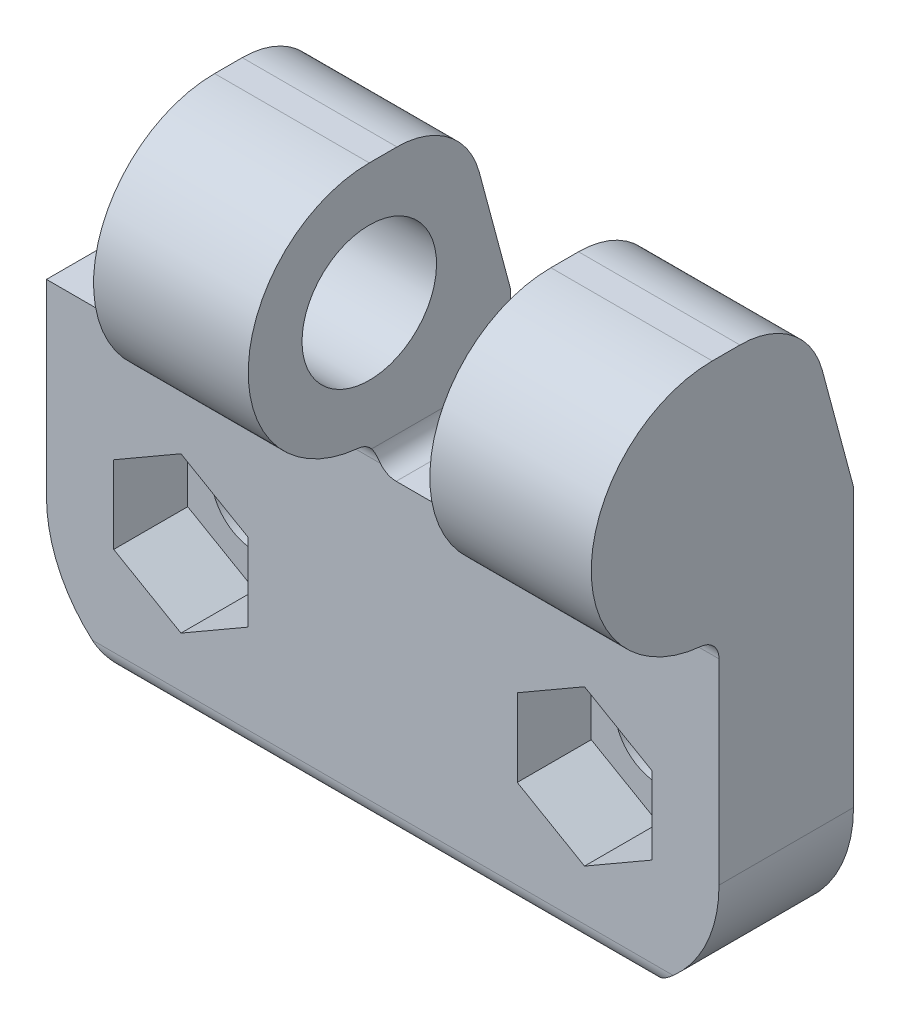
ISO-10303-21;
HEADER;
FILE_DESCRIPTION(('STEP AP214'),'2;1');
FILE_NAME('part.step','',(''),(''),'','','');
FILE_SCHEMA(('AUTOMOTIVE_DESIGN { 1 0 10303 214 1 1 1 1 }'));
ENDSEC;
DATA;
#1=APPLICATION_CONTEXT('core data for automotive mechanical design processes');
#2=APPLICATION_PROTOCOL_DEFINITION('international standard','automotive_design',2000,#1);
#3=PRODUCT_CONTEXT('',#1,'mechanical');
#4=PRODUCT('Part','Part','',(#3));
#5=PRODUCT_RELATED_PRODUCT_CATEGORY('part','',(#4));
#6=PRODUCT_DEFINITION_FORMATION('','',#4);
#7=PRODUCT_DEFINITION_CONTEXT('part definition',#1,'design');
#8=PRODUCT_DEFINITION('design','',#6,#7);
#9=PRODUCT_DEFINITION_SHAPE('','',#8);
#10=(LENGTH_UNIT() NAMED_UNIT(*) SI_UNIT(.MILLI.,.METRE.));
#11=(NAMED_UNIT(*) PLANE_ANGLE_UNIT() SI_UNIT($,.RADIAN.));
#12=(NAMED_UNIT(*) SI_UNIT($,.STERADIAN.) SOLID_ANGLE_UNIT());
#13=UNCERTAINTY_MEASURE_WITH_UNIT(LENGTH_MEASURE(1.E-05),#10,'distance_accuracy_value','');
#14=(GEOMETRIC_REPRESENTATION_CONTEXT(3) GLOBAL_UNCERTAINTY_ASSIGNED_CONTEXT((#13)) GLOBAL_UNIT_ASSIGNED_CONTEXT((#10,
#11,#12)) REPRESENTATION_CONTEXT('',''));
#15=CARTESIAN_POINT('',(0.,0.,0.));
#16=DIRECTION('',(0.,0.,1.));
#17=DIRECTION('',(1.,0.,0.));
#18=AXIS2_PLACEMENT_3D('',#15,#16,#17);
#19=CARTESIAN_POINT('',(-10.5,-12.,2.09368));
#20=DIRECTION('',(0.,-1.,0.));
#21=DIRECTION('',(1.,0.,0.));
#22=AXIS2_PLACEMENT_3D('',#19,#20,#21);
#23=PLANE('',#22);
#24=DIRECTION('',(1.,0.,0.));
#25=VECTOR('',#24,1.);
#26=CARTESIAN_POINT('',(-10.5,-12.,0.));
#27=LINE('',#26,#25);
#28=CARTESIAN_POINT('',(0.,-12.,0.));
#29=VERTEX_POINT('',#28);
#30=CARTESIAN_POINT('',(30.,-12.,0.));
#31=VERTEX_POINT('',#30);
#32=EDGE_CURVE('E292',#29,#31,#27,.T.);
#33=ORIENTED_EDGE('',*,*,#32,.T.);
#34=DIRECTION('',(0.,0.,-1.));
#35=VECTOR('',#34,1.);
#36=CARTESIAN_POINT('',(30.,-12.,19.4999999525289));
#37=LINE('',#36,#35);
#38=CARTESIAN_POINT('',(30.,-12.,2.09368));
#39=VERTEX_POINT('',#38);
#40=EDGE_CURVE('E301',#39,#31,#37,.T.);
#41=ORIENTED_EDGE('',*,*,#40,.F.);
#42=DIRECTION('',(1.,0.,0.));
#43=VECTOR('',#42,1.);
#44=CARTESIAN_POINT('',(-10.5,-12.,2.09368));
#45=LINE('',#44,#43);
#46=CARTESIAN_POINT('',(0.,-12.,2.09368));
#47=VERTEX_POINT('',#46);
#48=EDGE_CURVE('E372',#47,#39,#45,.T.);
#49=ORIENTED_EDGE('',*,*,#48,.F.);
#50=DIRECTION('',(0.,0.,-1.));
#51=VECTOR('',#50,1.);
#52=CARTESIAN_POINT('',(0.,-12.,19.4999999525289));
#53=LINE('',#52,#51);
#54=EDGE_CURVE('E275',#47,#29,#53,.T.);
#55=ORIENTED_EDGE('',*,*,#54,.T.);
#56=EDGE_LOOP('',(#33,#41,#49,#55));
#57=FACE_BOUND('',#56,.T.);
#58=ADVANCED_FACE('F14',(#57),#23,.T.);
#59=CARTESIAN_POINT('',(-10.5,-10.973200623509,8.7787764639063));
#60=DIRECTION('',(0.,-0.984807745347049,0.1736482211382));
#61=DIRECTION('',(0.,-0.1736482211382,-0.984807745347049));
#62=AXIS2_PLACEMENT_3D('',#59,#60,#61);
#63=PLANE('',#62);
#64=CARTESIAN_POINT('',(30.,-2.,59.6683128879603));
#65=DIRECTION('',(0.,-0.984807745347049,0.1736482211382));
#66=DIRECTION('',(0.,-0.1736482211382,-0.984807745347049));
#67=AXIS2_PLACEMENT_3D('',#64,#65,#66);
#68=ELLIPSE('',#67,57.5876904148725,10.);
#69=CARTESIAN_POINT('',(34.4138045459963,-10.973200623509,8.7787764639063));
#70=VERTEX_POINT('',#69);
#71=CARTESIAN_POINT('',(31.7238231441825,-11.850301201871,3.80449318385));
#72=VERTEX_POINT('',#71);
#73=EDGE_CURVE('E757',#70,#72,#68,.F.);
#74=ORIENTED_EDGE('',*,*,#73,.F.);
#75=DIRECTION('',(1.,0.,0.));
#76=VECTOR('',#75,1.);
#77=CARTESIAN_POINT('',(-10.5,-10.973200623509,8.7787764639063));
#78=LINE('',#77,#76);
#79=CARTESIAN_POINT('',(-4.41380454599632,-10.973200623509,8.7787764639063));
#80=VERTEX_POINT('',#79);
#81=EDGE_CURVE('E383',#80,#70,#78,.T.);
#82=ORIENTED_EDGE('',*,*,#81,.F.);
#83=CARTESIAN_POINT('',(0.,-2.,59.6683128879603));
#84=DIRECTION('',(0.,-0.984807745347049,0.1736482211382));
#85=DIRECTION('',(0.,-0.1736482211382,-0.984807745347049));
#86=AXIS2_PLACEMENT_3D('',#83,#84,#85);
#87=ELLIPSE('',#86,57.5876904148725,10.);
#88=CARTESIAN_POINT('',(-1.72382314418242,-11.850301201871,3.80449318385));
#89=VERTEX_POINT('',#88);
#90=EDGE_CURVE('E305',#89,#80,#87,.F.);
#91=ORIENTED_EDGE('',*,*,#90,.F.);
#92=DIRECTION('',(1.,0.,0.));
#93=VECTOR('',#92,1.);
#94=CARTESIAN_POINT('',(-10.5,-11.850301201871,3.80449318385));
#95=LINE('',#94,#93);
#96=EDGE_CURVE('E380',#89,#72,#95,.T.);
#97=ORIENTED_EDGE('',*,*,#96,.T.);
#98=EDGE_LOOP('',(#74,#82,#91,#97));
#99=FACE_BOUND('',#98,.T.);
#100=ADVANCED_FACE('F358',(#99),#63,.T.);
#101=CARTESIAN_POINT('',(-10.5,-12.,0.));
#102=DIRECTION('',(0.,0.,-1.));
#103=DIRECTION('',(-1.,0.,0.));
#104=AXIS2_PLACEMENT_3D('',#101,#102,#103);
#105=PLANE('',#104);
#106=DIRECTION('',(0.,1.,0.));
#107=VECTOR('',#106,1.);
#108=CARTESIAN_POINT('',(40.,-1.99999999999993,0.));
#109=LINE('',#108,#107);
#110=CARTESIAN_POINT('',(40.,-1.99999999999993,0.));
#111=VERTEX_POINT('',#110);
#112=CARTESIAN_POINT('',(40.,18.63888,0.));
#113=VERTEX_POINT('',#112);
#114=EDGE_CURVE('E276',#111,#113,#109,.T.);
#115=ORIENTED_EDGE('',*,*,#114,.F.);
#116=CARTESIAN_POINT('',(30.,-2.,0.));
#117=DIRECTION('',(0.,0.,1.));
#118=DIRECTION('',(1.,0.,0.));
#119=AXIS2_PLACEMENT_3D('',#116,#117,#118);
#120=CIRCLE('',#119,10.);
#121=EDGE_CURVE('E293',#31,#111,#120,.T.);
#122=ORIENTED_EDGE('',*,*,#121,.F.);
#123=ORIENTED_EDGE('',*,*,#32,.F.);
#124=CARTESIAN_POINT('',(0.,-2.,0.));
#125=DIRECTION('',(0.,0.,1.));
#126=DIRECTION('',(1.,0.,0.));
#127=AXIS2_PLACEMENT_3D('',#124,#125,#126);
#128=CIRCLE('',#127,10.);
#129=CARTESIAN_POINT('',(-10.,-1.99999999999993,0.));
#130=VERTEX_POINT('',#129);
#131=EDGE_CURVE('E271',#130,#29,#128,.T.);
#132=ORIENTED_EDGE('',*,*,#131,.F.);
#133=DIRECTION('',(0.,-1.,0.));
#134=VECTOR('',#133,1.);
#135=CARTESIAN_POINT('',(-10.,-1.99999999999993,0.));
#136=LINE('',#135,#134);
#137=CARTESIAN_POINT('',(-10.,12.,0.));
#138=VERTEX_POINT('',#137);
#139=EDGE_CURVE('E279',#138,#130,#136,.T.);
#140=ORIENTED_EDGE('',*,*,#139,.F.);
#141=DIRECTION('',(-1.,0.,0.));
#142=VECTOR('',#141,1.);
#143=CARTESIAN_POINT('',(-10.5,12.,0.));
#144=LINE('',#143,#142);
#145=CARTESIAN_POINT('',(1.5,12.,0.));
#146=VERTEX_POINT('',#145);
#147=EDGE_CURVE('E673',#146,#138,#144,.T.);
#148=ORIENTED_EDGE('',*,*,#147,.F.);
#149=CARTESIAN_POINT('',(1.5000000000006,13.4999999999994,0.));
#150=DIRECTION('',(0.,0.,-1.));
#151=DIRECTION('',(-1.,0.,0.));
#152=AXIS2_PLACEMENT_3D('',#149,#150,#151);
#153=CIRCLE('',#152,1.49999999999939);
#154=CARTESIAN_POINT('',(3.,13.5,0.));
#155=VERTEX_POINT('',#154);
#156=EDGE_CURVE('E671',#155,#146,#153,.T.);
#157=ORIENTED_EDGE('',*,*,#156,.F.);
#158=DIRECTION('',(0.,-1.,0.));
#159=VECTOR('',#158,1.);
#160=CARTESIAN_POINT('',(3.,-12.,0.));
#161=LINE('',#160,#159);
#162=CARTESIAN_POINT('',(3.,18.63888,0.));
#163=VERTEX_POINT('',#162);
#164=EDGE_CURVE('E616',#163,#155,#161,.T.);
#165=ORIENTED_EDGE('',*,*,#164,.F.);
#166=DIRECTION('',(1.,0.,0.));
#167=VECTOR('',#166,1.);
#168=CARTESIAN_POINT('',(-10.5,18.63888,0.));
#169=LINE('',#168,#167);
#170=CARTESIAN_POINT('',(14.5,18.63888,0.));
#171=VERTEX_POINT('',#170);
#172=EDGE_CURVE('E417',#163,#171,#169,.T.);
#173=ORIENTED_EDGE('',*,*,#172,.T.);
#174=DIRECTION('',(0.,1.,0.));
#175=VECTOR('',#174,1.);
#176=CARTESIAN_POINT('',(14.5,-12.,0.));
#177=LINE('',#176,#175);
#178=CARTESIAN_POINT('',(14.5,13.5,0.));
#179=VERTEX_POINT('',#178);
#180=EDGE_CURVE('E608',#179,#171,#177,.T.);
#181=ORIENTED_EDGE('',*,*,#180,.F.);
#182=CARTESIAN_POINT('',(15.9999999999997,13.4999999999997,0.));
#183=DIRECTION('',(0.,0.,-1.));
#184=DIRECTION('',(-1.,0.,0.));
#185=AXIS2_PLACEMENT_3D('',#182,#183,#184);
#186=CIRCLE('',#185,1.49999999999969);
#187=CARTESIAN_POINT('',(16.,12.,0.));
#188=VERTEX_POINT('',#187);
#189=EDGE_CURVE('E661',#188,#179,#186,.T.);
#190=ORIENTED_EDGE('',*,*,#189,.F.);
#191=DIRECTION('',(-1.,0.,0.));
#192=VECTOR('',#191,1.);
#193=CARTESIAN_POINT('',(-10.5,12.,0.));
#194=LINE('',#193,#192);
#195=CARTESIAN_POINT('',(26.5,12.,0.));
#196=VERTEX_POINT('',#195);
#197=EDGE_CURVE('E662',#196,#188,#194,.T.);
#198=ORIENTED_EDGE('',*,*,#197,.F.);
#199=CARTESIAN_POINT('',(26.5000000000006,13.4999999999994,0.));
#200=DIRECTION('',(0.,0.,-1.));
#201=DIRECTION('',(-1.,0.,0.));
#202=AXIS2_PLACEMENT_3D('',#199,#200,#201);
#203=CIRCLE('',#202,1.49999999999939);
#204=CARTESIAN_POINT('',(28.,13.5,0.));
#205=VERTEX_POINT('',#204);
#206=EDGE_CURVE('E627',#205,#196,#203,.T.);
#207=ORIENTED_EDGE('',*,*,#206,.F.);
#208=DIRECTION('',(0.,-1.,0.));
#209=VECTOR('',#208,1.);
#210=CARTESIAN_POINT('',(28.,-12.,0.));
#211=LINE('',#210,#209);
#212=CARTESIAN_POINT('',(28.,18.63888,0.));
#213=VERTEX_POINT('',#212);
#214=EDGE_CURVE('E600',#213,#205,#211,.T.);
#215=ORIENTED_EDGE('',*,*,#214,.F.);
#216=EDGE_CURVE('E414',#213,#113,#169,.T.);
#217=ORIENTED_EDGE('',*,*,#216,.T.);
#218=EDGE_LOOP('',(#115,#122,#123,#132,#140,#148,#157,#165,#173,#181,#190,#198,#207,#215,#217));
#219=FACE_BOUND('',#218,.T.);
#220=CARTESIAN_POINT('',(0.,0.,0.));
#221=DIRECTION('',(0.,0.,-1.));
#222=DIRECTION('',(-1.,0.,0.));
#223=AXIS2_PLACEMENT_3D('',#220,#221,#222);
#224=CIRCLE('',#223,3.25);
#225=CARTESIAN_POINT('',(-3.25,0.,0.));
#226=VERTEX_POINT('',#225);
#227=EDGE_CURVE('E473',#226,#226,#224,.F.);
#228=ORIENTED_EDGE('',*,*,#227,.T.);
#229=EDGE_LOOP('',(#228));
#230=FACE_BOUND('',#229,.T.);
#231=CARTESIAN_POINT('',(30.,0.,0.));
#232=DIRECTION('',(0.,0.,-1.));
#233=DIRECTION('',(-1.,0.,0.));
#234=AXIS2_PLACEMENT_3D('',#231,#232,#233);
#235=CIRCLE('',#234,3.25);
#236=CARTESIAN_POINT('',(26.75,0.,0.));
#237=VERTEX_POINT('',#236);
#238=EDGE_CURVE('E474',#237,#237,#235,.F.);
#239=ORIENTED_EDGE('',*,*,#238,.T.);
#240=EDGE_LOOP('',(#239));
#241=FACE_BOUND('',#240,.T.);
#242=ADVANCED_FACE('F288',(#219,#230,#241),#105,.T.);
#243=CARTESIAN_POINT('',(35.,-8.660254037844,4.5));
#244=DIRECTION('',(0.,0.,1.));
#245=DIRECTION('',(1.,0.,0.));
#246=AXIS2_PLACEMENT_3D('',#243,#244,#245);
#247=PLANE('',#246);
#248=DIRECTION('',(0.866025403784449,-0.499999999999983,0.));
#249=VECTOR('',#248,1.);
#250=CARTESIAN_POINT('',(25.,-2.886751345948,4.5));
#251=LINE('',#250,#249);
#252=CARTESIAN_POINT('',(25.,-2.886751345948,4.5));
#253=VERTEX_POINT('',#252);
#254=CARTESIAN_POINT('',(30.,-5.773502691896,4.5));
#255=VERTEX_POINT('',#254);
#256=EDGE_CURVE('E540',#253,#255,#251,.T.);
#257=ORIENTED_EDGE('',*,*,#256,.T.);
#258=DIRECTION('',(0.866025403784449,0.499999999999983,0.));
#259=VECTOR('',#258,1.);
#260=CARTESIAN_POINT('',(30.,-5.773502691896,4.5));
#261=LINE('',#260,#259);
#262=CARTESIAN_POINT('',(35.,-2.886751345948,4.5));
#263=VERTEX_POINT('',#262);
#264=EDGE_CURVE('E541',#255,#263,#261,.T.);
#265=ORIENTED_EDGE('',*,*,#264,.T.);
#266=DIRECTION('',(0.,1.,0.));
#267=VECTOR('',#266,1.);
#268=CARTESIAN_POINT('',(35.,-2.886751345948,4.5));
#269=LINE('',#268,#267);
#270=CARTESIAN_POINT('',(35.,2.886751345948,4.5));
#271=VERTEX_POINT('',#270);
#272=EDGE_CURVE('E544',#263,#271,#269,.T.);
#273=ORIENTED_EDGE('',*,*,#272,.T.);
#274=DIRECTION('',(-0.866025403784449,0.499999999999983,0.));
#275=VECTOR('',#274,1.);
#276=CARTESIAN_POINT('',(35.,2.886751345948,4.5));
#277=LINE('',#276,#275);
#278=CARTESIAN_POINT('',(30.,5.773502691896,4.5));
#279=VERTEX_POINT('',#278);
#280=EDGE_CURVE('E547',#271,#279,#277,.T.);
#281=ORIENTED_EDGE('',*,*,#280,.T.);
#282=DIRECTION('',(-0.866025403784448,-0.499999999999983,0.));
#283=VECTOR('',#282,1.);
#284=CARTESIAN_POINT('',(30.,5.773502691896,4.5));
#285=LINE('',#284,#283);
#286=CARTESIAN_POINT('',(25.,2.886751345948,4.5));
#287=VERTEX_POINT('',#286);
#288=EDGE_CURVE('E550',#279,#287,#285,.T.);
#289=ORIENTED_EDGE('',*,*,#288,.T.);
#290=DIRECTION('',(0.,-1.,0.));
#291=VECTOR('',#290,1.);
#292=CARTESIAN_POINT('',(25.,2.886751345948,4.5));
#293=LINE('',#292,#291);
#294=EDGE_CURVE('E553',#287,#253,#293,.T.);
#295=ORIENTED_EDGE('',*,*,#294,.T.);
#296=EDGE_LOOP('',(#257,#265,#273,#281,#289,#295));
#297=FACE_BOUND('',#296,.T.);
#298=CARTESIAN_POINT('',(30.,0.,4.5));
#299=DIRECTION('',(0.,0.,1.));
#300=DIRECTION('',(1.,0.,0.));
#301=AXIS2_PLACEMENT_3D('',#298,#299,#300);
#302=CIRCLE('',#301,3.25);
#303=CARTESIAN_POINT('',(33.25,0.,4.5));
#304=VERTEX_POINT('',#303);
#305=EDGE_CURVE('E475',#304,#304,#302,.F.);
#306=ORIENTED_EDGE('',*,*,#305,.T.);
#307=EDGE_LOOP('',(#306));
#308=FACE_BOUND('',#307,.T.);
#309=ADVANCED_FACE('F788',(#297,#308),#247,.T.);
#310=CARTESIAN_POINT('',(5.,-8.660254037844,4.5));
#311=DIRECTION('',(0.,0.,1.));
#312=DIRECTION('',(1.,0.,0.));
#313=AXIS2_PLACEMENT_3D('',#310,#311,#312);
#314=PLANE('',#313);
#315=DIRECTION('',(0.866025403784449,-0.499999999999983,0.));
#316=VECTOR('',#315,1.);
#317=CARTESIAN_POINT('',(-5.,-2.886751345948,4.5));
#318=LINE('',#317,#316);
#319=CARTESIAN_POINT('',(-5.,-2.886751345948,4.5));
#320=VERTEX_POINT('',#319);
#321=CARTESIAN_POINT('',(0.,-5.773502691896,4.5));
#322=VERTEX_POINT('',#321);
#323=EDGE_CURVE('E505',#320,#322,#318,.T.);
#324=ORIENTED_EDGE('',*,*,#323,.T.);
#325=DIRECTION('',(0.866025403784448,0.499999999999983,0.));
#326=VECTOR('',#325,1.);
#327=CARTESIAN_POINT('',(0.,-5.773502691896,4.5));
#328=LINE('',#327,#326);
#329=CARTESIAN_POINT('',(5.,-2.886751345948,4.5));
#330=VERTEX_POINT('',#329);
#331=EDGE_CURVE('E506',#322,#330,#328,.T.);
#332=ORIENTED_EDGE('',*,*,#331,.T.);
#333=DIRECTION('',(0.,1.,0.));
#334=VECTOR('',#333,1.);
#335=CARTESIAN_POINT('',(5.,-2.886751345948,4.5));
#336=LINE('',#335,#334);
#337=CARTESIAN_POINT('',(5.,2.886751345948,4.5));
#338=VERTEX_POINT('',#337);
#339=EDGE_CURVE('E509',#330,#338,#336,.T.);
#340=ORIENTED_EDGE('',*,*,#339,.T.);
#341=DIRECTION('',(-0.866025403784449,0.499999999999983,0.));
#342=VECTOR('',#341,1.);
#343=CARTESIAN_POINT('',(5.,2.886751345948,4.5));
#344=LINE('',#343,#342);
#345=CARTESIAN_POINT('',(0.,5.773502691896,4.5));
#346=VERTEX_POINT('',#345);
#347=EDGE_CURVE('E512',#338,#346,#344,.T.);
#348=ORIENTED_EDGE('',*,*,#347,.T.);
#349=DIRECTION('',(-0.866025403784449,-0.499999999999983,0.));
#350=VECTOR('',#349,1.);
#351=CARTESIAN_POINT('',(0.,5.773502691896,4.5));
#352=LINE('',#351,#350);
#353=CARTESIAN_POINT('',(-5.,2.886751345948,4.5));
#354=VERTEX_POINT('',#353);
#355=EDGE_CURVE('E515',#346,#354,#352,.T.);
#356=ORIENTED_EDGE('',*,*,#355,.T.);
#357=DIRECTION('',(0.,-1.,0.));
#358=VECTOR('',#357,1.);
#359=CARTESIAN_POINT('',(-5.,2.886751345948,4.5));
#360=LINE('',#359,#358);
#361=EDGE_CURVE('E518',#354,#320,#360,.T.);
#362=ORIENTED_EDGE('',*,*,#361,.T.);
#363=EDGE_LOOP('',(#324,#332,#340,#348,#356,#362));
#364=FACE_BOUND('',#363,.T.);
#365=CARTESIAN_POINT('',(0.,0.,4.5));
#366=DIRECTION('',(0.,0.,1.));
#367=DIRECTION('',(1.,0.,0.));
#368=AXIS2_PLACEMENT_3D('',#365,#366,#367);
#369=CIRCLE('',#368,3.25);
#370=CARTESIAN_POINT('',(3.25,0.,4.5));
#371=VERTEX_POINT('',#370);
#372=EDGE_CURVE('E470',#371,#371,#369,.F.);
#373=ORIENTED_EDGE('',*,*,#372,.T.);
#374=EDGE_LOOP('',(#373));
#375=FACE_BOUND('',#374,.T.);
#376=ADVANCED_FACE('F793',(#364,#375),#314,.T.);
#377=CARTESIAN_POINT('',(28.,13.5,23.5));
#378=DIRECTION('',(-1.,0.,0.));
#379=DIRECTION('',(0.,-1.,0.));
#380=AXIS2_PLACEMENT_3D('',#377,#378,#379);
#381=PLANE('',#380);
#382=CARTESIAN_POINT('',(28.,23.0000010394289,10.5000009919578));
#383=DIRECTION('',(-1.,0.,0.));
#384=DIRECTION('',(0.,-1.,0.));
#385=AXIS2_PLACEMENT_3D('',#382,#383,#384);
#386=CIRCLE('',#385,8.99999896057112);
#387=CARTESIAN_POINT('',(28.,32.,10.5));
#388=VERTEX_POINT('',#387);
#389=CARTESIAN_POINT('',(28.,14.0392784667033,11.3399011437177));
#390=VERTEX_POINT('',#389);
#391=EDGE_CURVE('E675',#388,#390,#386,.F.);
#392=ORIENTED_EDGE('',*,*,#391,.F.);
#393=DIRECTION('',(0.,0.,-1.));
#394=VECTOR('',#393,1.);
#395=CARTESIAN_POINT('',(28.,32.,8.4448));
#396=LINE('',#395,#394);
#397=CARTESIAN_POINT('',(28.,32.,8.44480224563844));
#398=VERTEX_POINT('',#397);
#399=EDGE_CURVE('E594',#388,#398,#396,.T.);
#400=ORIENTED_EDGE('',*,*,#399,.T.);
#401=CARTESIAN_POINT('',(28.,25.6601833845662,8.44480224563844));
#402=DIRECTION('',(1.,0.,0.));
#403=DIRECTION('',(0.,1.,0.));
#404=AXIS2_PLACEMENT_3D('',#401,#402,#403);
#405=CIRCLE('',#404,6.33981661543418);
#406=CARTESIAN_POINT('',(28.,27.3010467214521,2.3210091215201));
#407=VERTEX_POINT('',#406);
#408=EDGE_CURVE('E596',#398,#407,#405,.F.);
#409=ORIENTED_EDGE('',*,*,#408,.T.);
#410=DIRECTION('',(0.,-0.965926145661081,-0.258817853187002));
#411=VECTOR('',#410,1.);
#412=CARTESIAN_POINT('',(28.,18.63888,0.));
#413=LINE('',#412,#411);
#414=EDGE_CURVE('E598',#407,#213,#413,.T.);
#415=ORIENTED_EDGE('',*,*,#414,.T.);
#416=ORIENTED_EDGE('',*,*,#214,.T.);
#417=DIRECTION('',(0.,0.,1.));
#418=VECTOR('',#417,1.);
#419=CARTESIAN_POINT('',(28.,13.5,-2.5));
#420=LINE('',#419,#418);
#421=CARTESIAN_POINT('',(28.,13.5,10.3310094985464));
#422=VERTEX_POINT('',#421);
#423=EDGE_CURVE('E576',#205,#422,#420,.T.);
#424=ORIENTED_EDGE('',*,*,#423,.T.);
#425=CARTESIAN_POINT('',(28.,12.5679235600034,11.4778031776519));
#426=DIRECTION('',(-1.,0.,0.));
#427=DIRECTION('',(0.,-1.,0.));
#428=AXIS2_PLACEMENT_3D('',#425,#426,#427);
#429=CIRCLE('',#428,1.47780317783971);
#430=EDGE_CURVE('E421',#390,#422,#429,.T.);
#431=ORIENTED_EDGE('',*,*,#430,.F.);
#432=EDGE_LOOP('',(#392,#400,#409,#415,#416,#424,#431));
#433=FACE_BOUND('',#432,.T.);
#434=CARTESIAN_POINT('',(28.,23.,10.5));
#435=DIRECTION('',(-1.,0.,0.));
#436=DIRECTION('',(0.,-1.,0.));
#437=AXIS2_PLACEMENT_3D('',#434,#435,#436);
#438=CIRCLE('',#437,5.);
#439=CARTESIAN_POINT('',(28.,18.,10.5));
#440=VERTEX_POINT('',#439);
#441=EDGE_CURVE('E441',#440,#440,#438,.F.);
#442=ORIENTED_EDGE('',*,*,#441,.T.);
#443=EDGE_LOOP('',(#442));
#444=FACE_BOUND('',#443,.T.);
#445=ADVANCED_FACE('F734',(#433,#444),#381,.T.);
#446=CARTESIAN_POINT('',(-10.5,12.5679235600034,11.4778031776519));
#447=DIRECTION('',(1.,0.,0.));
#448=DIRECTION('',(0.,1.,0.));
#449=AXIS2_PLACEMENT_3D('',#446,#447,#448);
#450=CYLINDRICAL_SURFACE('',#449,1.47780317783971);
#451=CARTESIAN_POINT('',(2.67524022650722,12.5679,10.));
#452=CARTESIAN_POINT('',(2.69534695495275,12.5932496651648,9.9999997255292));
#453=CARTESIAN_POINT('',(2.71462569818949,12.6192459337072,10.0006524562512));
#454=CARTESIAN_POINT('',(2.75144042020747,12.6723870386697,10.0034560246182));
#455=CARTESIAN_POINT('',(2.76897541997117,12.6995325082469,10.0056076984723));
#456=CARTESIAN_POINT('',(2.81869486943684,12.7822534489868,10.0145793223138));
#457=CARTESIAN_POINT('',(2.84812485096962,12.8392792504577,10.0239134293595));
#458=CARTESIAN_POINT('',(2.89905949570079,12.9553252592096,10.0504349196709));
#459=CARTESIAN_POINT('',(2.92052852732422,13.0143531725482,10.067656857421));
#460=CARTESIAN_POINT('',(2.95539281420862,13.1317870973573,10.1103756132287));
#461=CARTESIAN_POINT('',(2.96879094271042,13.190193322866,10.1358694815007));
#462=CARTESIAN_POINT('',(2.98614129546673,13.2916068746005,10.1883468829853));
#463=CARTESIAN_POINT('',(2.9915178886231,13.3351901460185,10.2137874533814));
#464=CARTESIAN_POINT('',(2.99845626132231,13.4197494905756,10.2691385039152));
#465=CARTESIAN_POINT('',(3.00001819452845,13.4607256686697,10.2990488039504));
#466=CARTESIAN_POINT('',(3.,13.5,10.3310094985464));
#467=B_SPLINE_CURVE_WITH_KNOTS('',3,(#451,#452,#453,#454,#455,#456,#457,#458,#459,#460,#461,
#462,#463,#464,#465,#466),.UNSPECIFIED.,.F.,.F.,(4,2,2,2,2,2,2,4),(0.,0.0970229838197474,
0.194100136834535,0.387627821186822,0.582011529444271,0.776325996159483,0.928177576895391,
1.08002304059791),.UNSPECIFIED.);
#468=CARTESIAN_POINT('',(2.67524022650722,12.5679,10.));
#469=VERTEX_POINT('',#468);
#470=CARTESIAN_POINT('',(3.,13.5,10.3310094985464));
#471=VERTEX_POINT('',#470);
#472=EDGE_CURVE('E664',#469,#471,#467,.T.);
#473=ORIENTED_EDGE('',*,*,#472,.F.);
#474=DIRECTION('',(1.,0.,0.));
#475=VECTOR('',#474,1.);
#476=CARTESIAN_POINT('',(-10.5,12.5679,10.));
#477=LINE('',#476,#475);
#478=CARTESIAN_POINT('',(14.8247597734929,12.5679,10.));
#479=VERTEX_POINT('',#478);
#480=EDGE_CURVE('E397',#469,#479,#477,.T.);
#481=ORIENTED_EDGE('',*,*,#480,.T.);
#482=CARTESIAN_POINT('',(14.5,13.5,10.3310094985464));
#483=CARTESIAN_POINT('',(14.5000001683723,13.4748927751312,10.3106017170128));
#484=CARTESIAN_POINT('',(14.5006313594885,13.4491194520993,10.2910262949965));
#485=CARTESIAN_POINT('',(14.5033494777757,13.396384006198,10.2536291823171));
#486=CARTESIAN_POINT('',(14.5054372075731,13.3694212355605,10.2358084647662));
#487=CARTESIAN_POINT('',(14.5141565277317,13.2871827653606,10.1852526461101));
#488=CARTESIAN_POINT('',(14.5232418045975,13.2303940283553,10.1552919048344));
#489=CARTESIAN_POINT('',(14.5491276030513,13.1146409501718,10.1033765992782));
#490=CARTESIAN_POINT('',(14.5659619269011,13.0556681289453,10.0814578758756));
#491=CARTESIAN_POINT('',(14.6078020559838,12.9381559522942,10.0458124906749));
#492=CARTESIAN_POINT('',(14.6328048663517,12.8796164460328,10.0320828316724));
#493=CARTESIAN_POINT('',(14.6843473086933,12.7778034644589,10.0142748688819));
#494=CARTESIAN_POINT('',(14.7093578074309,12.733988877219,10.0087433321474));
#495=CARTESIAN_POINT('',(14.7638186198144,12.6488646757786,10.001596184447));
#496=CARTESIAN_POINT('',(14.79326882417,12.6075549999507,9.99998047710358));
#497=CARTESIAN_POINT('',(14.8247597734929,12.5679,10.));
#498=B_SPLINE_CURVE_WITH_KNOTS('',3,(#482,#483,#484,#485,#486,#487,#488,#489,#490,#491,#492,
#493,#494,#495,#496,#497),.UNSPECIFIED.,.F.,.F.,(4,2,2,2,2,2,2,4),(0.,0.0970210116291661,
0.19409552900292,0.387623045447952,0.582002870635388,0.776311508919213,0.92816920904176,
1.08002317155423),.UNSPECIFIED.);
#499=CARTESIAN_POINT('',(14.5,13.5,10.3310094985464));
#500=VERTEX_POINT('',#499);
#501=EDGE_CURVE('E655',#500,#479,#498,.T.);
#502=ORIENTED_EDGE('',*,*,#501,.F.);
#503=CARTESIAN_POINT('',(14.5,12.5679235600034,11.4778031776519));
#504=DIRECTION('',(1.,0.,0.));
#505=DIRECTION('',(0.,1.,0.));
#506=AXIS2_PLACEMENT_3D('',#503,#504,#505);
#507=CIRCLE('',#506,1.47780317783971);
#508=CARTESIAN_POINT('',(14.5,14.0392784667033,11.3399011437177));
#509=VERTEX_POINT('',#508);
#510=EDGE_CURVE('E423',#500,#509,#507,.T.);
#511=ORIENTED_EDGE('',*,*,#510,.T.);
#512=DIRECTION('',(1.,0.,0.));
#513=VECTOR('',#512,1.);
#514=CARTESIAN_POINT('',(-10.5,14.0392784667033,11.3399011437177));
#515=LINE('',#514,#513);
#516=CARTESIAN_POINT('',(3.,14.0392784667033,11.3399011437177));
#517=VERTEX_POINT('',#516);
#518=EDGE_CURVE('E401',#517,#509,#515,.T.);
#519=ORIENTED_EDGE('',*,*,#518,.F.);
#520=CARTESIAN_POINT('',(3.,12.5679235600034,11.4778031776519));
#521=DIRECTION('',(-1.,0.,0.));
#522=DIRECTION('',(0.,-1.,0.));
#523=AXIS2_PLACEMENT_3D('',#520,#521,#522);
#524=CIRCLE('',#523,1.47780317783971);
#525=EDGE_CURVE('E419',#517,#471,#524,.T.);
#526=ORIENTED_EDGE('',*,*,#525,.T.);
#527=EDGE_LOOP('',(#473,#481,#502,#511,#519,#526));
#528=FACE_BOUND('',#527,.T.);
#529=ADVANCED_FACE('F696',(#528),#450,.F.);
#530=CARTESIAN_POINT('',(-10.5,18.63888,0.));
#531=DIRECTION('',(0.,0.258817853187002,-0.965926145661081));
#532=DIRECTION('',(0.,0.965926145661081,0.258817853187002));
#533=AXIS2_PLACEMENT_3D('',#530,#531,#532);
#534=PLANE('',#533);
#535=DIRECTION('',(0.,-0.965926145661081,-0.258817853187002));
#536=VECTOR('',#535,1.);
#537=CARTESIAN_POINT('',(3.,18.63888,0.));
#538=LINE('',#537,#536);
#539=CARTESIAN_POINT('',(3.,27.3010467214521,2.3210091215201));
#540=VERTEX_POINT('',#539);
#541=EDGE_CURVE('E614',#540,#163,#538,.T.);
#542=ORIENTED_EDGE('',*,*,#541,.F.);
#543=DIRECTION('',(1.,0.,0.));
#544=VECTOR('',#543,1.);
#545=CARTESIAN_POINT('',(-10.5,27.3010467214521,2.3210091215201));
#546=LINE('',#545,#544);
#547=CARTESIAN_POINT('',(14.5,27.3010467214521,2.3210091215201));
#548=VERTEX_POINT('',#547);
#549=EDGE_CURVE('E413',#540,#548,#546,.T.);
#550=ORIENTED_EDGE('',*,*,#549,.T.);
#551=DIRECTION('',(0.,0.965926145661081,0.258817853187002));
#552=VECTOR('',#551,1.);
#553=CARTESIAN_POINT('',(14.5,18.63888,0.));
#554=LINE('',#553,#552);
#555=EDGE_CURVE('E606',#171,#548,#554,.T.);
#556=ORIENTED_EDGE('',*,*,#555,.F.);
#557=ORIENTED_EDGE('',*,*,#172,.F.);
#558=EDGE_LOOP('',(#542,#550,#556,#557));
#559=FACE_BOUND('',#558,.T.);
#560=ADVANCED_FACE('F714',(#559),#534,.T.);
#561=CARTESIAN_POINT('',(-10.5,25.6601833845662,8.44480224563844));
#562=DIRECTION('',(1.,0.,0.));
#563=DIRECTION('',(0.,1.,0.));
#564=AXIS2_PLACEMENT_3D('',#561,#562,#563);
#565=CYLINDRICAL_SURFACE('',#564,6.33981661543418);
#566=CARTESIAN_POINT('',(3.,25.6601833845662,8.44480224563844));
#567=DIRECTION('',(1.,0.,0.));
#568=DIRECTION('',(0.,1.,0.));
#569=AXIS2_PLACEMENT_3D('',#566,#567,#568);
#570=CIRCLE('',#569,6.33981661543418);
#571=CARTESIAN_POINT('',(3.,32.,8.44480224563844));
#572=VERTEX_POINT('',#571);
#573=EDGE_CURVE('E612',#572,#540,#570,.F.);
#574=ORIENTED_EDGE('',*,*,#573,.F.);
#575=DIRECTION('',(1.,0.,0.));
#576=VECTOR('',#575,1.);
#577=CARTESIAN_POINT('',(-10.5,32.0000000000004,8.44480224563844));
#578=LINE('',#577,#576);
#579=CARTESIAN_POINT('',(14.5,32.,8.44480224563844));
#580=VERTEX_POINT('',#579);
#581=EDGE_CURVE('E409',#572,#580,#578,.T.);
#582=ORIENTED_EDGE('',*,*,#581,.T.);
#583=CARTESIAN_POINT('',(14.5,25.6601833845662,8.44480224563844));
#584=DIRECTION('',(-1.,0.,0.));
#585=DIRECTION('',(0.,-1.,0.));
#586=AXIS2_PLACEMENT_3D('',#583,#584,#585);
#587=CIRCLE('',#586,6.33981661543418);
#588=EDGE_CURVE('E604',#548,#580,#587,.F.);
#589=ORIENTED_EDGE('',*,*,#588,.F.);
#590=ORIENTED_EDGE('',*,*,#549,.F.);
#591=EDGE_LOOP('',(#574,#582,#589,#590));
#592=FACE_BOUND('',#591,.T.);
#593=ADVANCED_FACE('F717',(#592),#565,.T.);
#594=CARTESIAN_POINT('',(-10.5,32.,8.4448));
#595=DIRECTION('',(0.,1.,0.));
#596=DIRECTION('',(-1.,0.,0.));
#597=AXIS2_PLACEMENT_3D('',#594,#595,#596);
#598=PLANE('',#597);
#599=DIRECTION('',(0.,0.,-1.));
#600=VECTOR('',#599,1.);
#601=CARTESIAN_POINT('',(3.,32.,8.4448));
#602=LINE('',#601,#600);
#603=CARTESIAN_POINT('',(3.,32.,10.5));
#604=VERTEX_POINT('',#603);
#605=EDGE_CURVE('E610',#604,#572,#602,.T.);
#606=ORIENTED_EDGE('',*,*,#605,.F.);
#607=DIRECTION('',(1.,0.,0.));
#608=VECTOR('',#607,1.);
#609=CARTESIAN_POINT('',(-10.5,32.,10.5));
#610=LINE('',#609,#608);
#611=CARTESIAN_POINT('',(14.5,32.,10.5));
#612=VERTEX_POINT('',#611);
#613=EDGE_CURVE('E405',#604,#612,#610,.T.);
#614=ORIENTED_EDGE('',*,*,#613,.T.);
#615=DIRECTION('',(0.,0.,1.));
#616=VECTOR('',#615,1.);
#617=CARTESIAN_POINT('',(14.5,32.,8.4448));
#618=LINE('',#617,#616);
#619=EDGE_CURVE('E602',#580,#612,#618,.T.);
#620=ORIENTED_EDGE('',*,*,#619,.F.);
#621=ORIENTED_EDGE('',*,*,#581,.F.);
#622=EDGE_LOOP('',(#606,#614,#620,#621));
#623=FACE_BOUND('',#622,.T.);
#624=ADVANCED_FACE('F688',(#623),#598,.T.);
#625=CARTESIAN_POINT('',(-10.5,23.0000010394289,10.5000009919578));
#626=DIRECTION('',(1.,0.,0.));
#627=DIRECTION('',(0.,1.,0.));
#628=AXIS2_PLACEMENT_3D('',#625,#626,#627);
#629=CYLINDRICAL_SURFACE('',#628,8.99999896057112);
#630=ORIENTED_EDGE('',*,*,#613,.F.);
#631=CARTESIAN_POINT('',(3.,23.0000010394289,10.5000009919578));
#632=DIRECTION('',(-1.,0.,0.));
#633=DIRECTION('',(0.,-1.,0.));
#634=AXIS2_PLACEMENT_3D('',#631,#632,#633);
#635=CIRCLE('',#634,8.99999896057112);
#636=EDGE_CURVE('E373',#604,#517,#635,.F.);
#637=ORIENTED_EDGE('',*,*,#636,.T.);
#638=ORIENTED_EDGE('',*,*,#518,.T.);
#639=CARTESIAN_POINT('',(14.5,23.0000010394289,10.5000009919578));
#640=DIRECTION('',(1.,0.,0.));
#641=DIRECTION('',(0.,1.,0.));
#642=AXIS2_PLACEMENT_3D('',#639,#640,#641);
#643=CIRCLE('',#642,8.99999896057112);
#644=EDGE_CURVE('E377',#509,#612,#643,.F.);
#645=ORIENTED_EDGE('',*,*,#644,.T.);
#646=EDGE_LOOP('',(#630,#637,#638,#645));
#647=FACE_BOUND('',#646,.T.);
#648=ADVANCED_FACE('F683',(#647),#629,.T.);
#649=CARTESIAN_POINT('',(40.,14.0392784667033,11.3399011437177));
#650=VERTEX_POINT('',#649);
#651=EDGE_CURVE('E398',#390,#650,#515,.T.);
#652=ORIENTED_EDGE('',*,*,#651,.T.);
#653=CARTESIAN_POINT('',(40.,23.0000010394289,10.5000009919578));
#654=DIRECTION('',(-1.,0.,0.));
#655=DIRECTION('',(0.,0.,1.));
#656=AXIS2_PLACEMENT_3D('',#653,#654,#655);
#657=CIRCLE('',#656,8.99999896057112);
#658=CARTESIAN_POINT('',(40.,32.,10.5));
#659=VERTEX_POINT('',#658);
#660=EDGE_CURVE('E745',#659,#650,#657,.F.);
#661=ORIENTED_EDGE('',*,*,#660,.F.);
#662=EDGE_CURVE('E402',#388,#659,#610,.T.);
#663=ORIENTED_EDGE('',*,*,#662,.F.);
#664=ORIENTED_EDGE('',*,*,#391,.T.);
#665=EDGE_LOOP('',(#652,#661,#663,#664));
#666=FACE_BOUND('',#665,.T.);
#667=ADVANCED_FACE('F770',(#666),#629,.T.);
#668=CARTESIAN_POINT('',(40.,12.5679235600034,11.4778031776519));
#669=DIRECTION('',(-1.,0.,0.));
#670=DIRECTION('',(0.,0.,1.));
#671=AXIS2_PLACEMENT_3D('',#668,#669,#670);
#672=CIRCLE('',#671,1.47780317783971);
#673=CARTESIAN_POINT('',(40.,12.5679,10.));
#674=VERTEX_POINT('',#673);
#675=EDGE_CURVE('E746',#650,#674,#672,.T.);
#676=ORIENTED_EDGE('',*,*,#675,.F.);
#677=ORIENTED_EDGE('',*,*,#651,.F.);
#678=ORIENTED_EDGE('',*,*,#430,.T.);
#679=CARTESIAN_POINT('',(27.6752402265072,12.5679,10.));
#680=CARTESIAN_POINT('',(27.6953469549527,12.5932496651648,9.9999997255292));
#681=CARTESIAN_POINT('',(27.7146256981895,12.6192459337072,10.0006524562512));
#682=CARTESIAN_POINT('',(27.7514404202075,12.6723870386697,10.0034560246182));
#683=CARTESIAN_POINT('',(27.7689754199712,12.6995325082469,10.0056076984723));
#684=CARTESIAN_POINT('',(27.8186948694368,12.7822534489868,10.0145793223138));
#685=CARTESIAN_POINT('',(27.8481248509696,12.8392792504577,10.0239134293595));
#686=CARTESIAN_POINT('',(27.8990594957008,12.9553252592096,10.0504349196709));
#687=CARTESIAN_POINT('',(27.9205285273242,13.0143531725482,10.067656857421));
#688=CARTESIAN_POINT('',(27.9553928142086,13.1317870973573,10.1103756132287));
#689=CARTESIAN_POINT('',(27.9687909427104,13.190193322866,10.1358694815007));
#690=CARTESIAN_POINT('',(27.9861412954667,13.2916068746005,10.1883468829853));
#691=CARTESIAN_POINT('',(27.9915178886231,13.3351901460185,10.2137874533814));
#692=CARTESIAN_POINT('',(27.9984562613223,13.4197494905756,10.2691385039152));
#693=CARTESIAN_POINT('',(28.0000181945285,13.4607256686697,10.2990488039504));
#694=CARTESIAN_POINT('',(28.,13.5,10.3310094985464));
#695=B_SPLINE_CURVE_WITH_KNOTS('',3,(#679,#680,#681,#682,#683,#684,#685,#686,#687,#688,#689,
#690,#691,#692,#693,#694),.UNSPECIFIED.,.F.,.F.,(4,2,2,2,2,2,2,4),(0.,0.0970229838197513,
0.194100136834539,0.387627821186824,0.58201152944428,0.776325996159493,0.9281775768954,
1.08002304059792),.UNSPECIFIED.);
#696=CARTESIAN_POINT('',(27.6752402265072,12.5679,10.));
#697=VERTEX_POINT('',#696);
#698=EDGE_CURVE('E618',#697,#422,#695,.T.);
#699=ORIENTED_EDGE('',*,*,#698,.F.);
#700=EDGE_CURVE('E394',#697,#674,#477,.T.);
#701=ORIENTED_EDGE('',*,*,#700,.T.);
#702=EDGE_LOOP('',(#676,#677,#678,#699,#701));
#703=FACE_BOUND('',#702,.T.);
#704=ADVANCED_FACE('F629',(#703),#450,.F.);
#705=DIRECTION('',(0.,0.965926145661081,0.258817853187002));
#706=VECTOR('',#705,1.);
#707=CARTESIAN_POINT('',(40.,18.63888,0.));
#708=LINE('',#707,#706);
#709=CARTESIAN_POINT('',(40.,27.3010467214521,2.3210091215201));
#710=VERTEX_POINT('',#709);
#711=EDGE_CURVE('E487',#113,#710,#708,.T.);
#712=ORIENTED_EDGE('',*,*,#711,.F.);
#713=ORIENTED_EDGE('',*,*,#216,.F.);
#714=ORIENTED_EDGE('',*,*,#414,.F.);
#715=EDGE_CURVE('E410',#407,#710,#546,.T.);
#716=ORIENTED_EDGE('',*,*,#715,.T.);
#717=EDGE_LOOP('',(#712,#713,#714,#716));
#718=FACE_BOUND('',#717,.T.);
#719=ADVANCED_FACE('F490',(#718),#534,.T.);
#720=CARTESIAN_POINT('',(40.,25.6601833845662,8.44480224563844));
#721=DIRECTION('',(-1.,0.,0.));
#722=DIRECTION('',(0.,0.,1.));
#723=AXIS2_PLACEMENT_3D('',#720,#721,#722);
#724=CIRCLE('',#723,6.33981661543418);
#725=CARTESIAN_POINT('',(40.,32.,8.44480224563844));
#726=VERTEX_POINT('',#725);
#727=EDGE_CURVE('E493',#710,#726,#724,.F.);
#728=ORIENTED_EDGE('',*,*,#727,.F.);
#729=ORIENTED_EDGE('',*,*,#715,.F.);
#730=ORIENTED_EDGE('',*,*,#408,.F.);
#731=EDGE_CURVE('E406',#398,#726,#578,.T.);
#732=ORIENTED_EDGE('',*,*,#731,.T.);
#733=EDGE_LOOP('',(#728,#729,#730,#732));
#734=FACE_BOUND('',#733,.T.);
#735=ADVANCED_FACE('F738',(#734),#565,.T.);
#736=DIRECTION('',(0.,0.,1.));
#737=VECTOR('',#736,1.);
#738=CARTESIAN_POINT('',(40.,32.,8.4448));
#739=LINE('',#738,#737);
#740=EDGE_CURVE('E497',#726,#659,#739,.T.);
#741=ORIENTED_EDGE('',*,*,#740,.F.);
#742=ORIENTED_EDGE('',*,*,#731,.F.);
#743=ORIENTED_EDGE('',*,*,#399,.F.);
#744=ORIENTED_EDGE('',*,*,#662,.T.);
#745=EDGE_LOOP('',(#741,#742,#743,#744));
#746=FACE_BOUND('',#745,.T.);
#747=ADVANCED_FACE('F743',(#746),#598,.T.);
#748=CARTESIAN_POINT('',(-10.5,12.5679,10.));
#749=DIRECTION('',(0.,0.,1.));
#750=DIRECTION('',(1.,0.,0.));
#751=AXIS2_PLACEMENT_3D('',#748,#749,#750);
#752=PLANE('',#751);
#753=DIRECTION('',(0.,-1.,0.));
#754=VECTOR('',#753,1.);
#755=CARTESIAN_POINT('',(40.,12.5679,10.));
#756=LINE('',#755,#754);
#757=CARTESIAN_POINT('',(40.,-1.99999999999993,10.));
#758=VERTEX_POINT('',#757);
#759=EDGE_CURVE('E9',#674,#758,#756,.T.);
#760=ORIENTED_EDGE('',*,*,#759,.F.);
#761=ORIENTED_EDGE('',*,*,#700,.F.);
#762=CARTESIAN_POINT('',(26.5000000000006,13.4999999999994,10.));
#763=DIRECTION('',(0.,0.,1.));
#764=DIRECTION('',(1.,0.,0.));
#765=AXIS2_PLACEMENT_3D('',#762,#763,#764);
#766=CIRCLE('',#765,1.49999999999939);
#767=CARTESIAN_POINT('',(26.5,12.,10.));
#768=VERTEX_POINT('',#767);
#769=EDGE_CURVE('E426',#768,#697,#766,.T.);
#770=ORIENTED_EDGE('',*,*,#769,.F.);
#771=DIRECTION('',(1.,0.,0.));
#772=VECTOR('',#771,1.);
#773=CARTESIAN_POINT('',(-10.5,12.,10.));
#774=LINE('',#773,#772);
#775=CARTESIAN_POINT('',(16.,12.,10.));
#776=VERTEX_POINT('',#775);
#777=EDGE_CURVE('E428',#776,#768,#774,.T.);
#778=ORIENTED_EDGE('',*,*,#777,.F.);
#779=CARTESIAN_POINT('',(15.9999999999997,13.4999999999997,10.));
#780=DIRECTION('',(0.,0.,1.));
#781=DIRECTION('',(1.,0.,0.));
#782=AXIS2_PLACEMENT_3D('',#779,#780,#781);
#783=CIRCLE('',#782,1.49999999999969);
#784=EDGE_CURVE('E430',#479,#776,#783,.T.);
#785=ORIENTED_EDGE('',*,*,#784,.F.);
#786=ORIENTED_EDGE('',*,*,#480,.F.);
#787=CARTESIAN_POINT('',(1.5000000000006,13.4999999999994,10.));
#788=DIRECTION('',(0.,0.,1.));
#789=DIRECTION('',(1.,0.,0.));
#790=AXIS2_PLACEMENT_3D('',#787,#788,#789);
#791=CIRCLE('',#790,1.49999999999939);
#792=CARTESIAN_POINT('',(1.5,12.,10.));
#793=VERTEX_POINT('',#792);
#794=EDGE_CURVE('E432',#793,#469,#791,.T.);
#795=ORIENTED_EDGE('',*,*,#794,.F.);
#796=DIRECTION('',(1.,0.,0.));
#797=VECTOR('',#796,1.);
#798=CARTESIAN_POINT('',(-10.5,12.,10.));
#799=LINE('',#798,#797);
#800=CARTESIAN_POINT('',(-10.,12.,10.));
#801=VERTEX_POINT('',#800);
#802=EDGE_CURVE('E434',#801,#793,#799,.T.);
#803=ORIENTED_EDGE('',*,*,#802,.F.);
#804=DIRECTION('',(0.,1.,0.));
#805=VECTOR('',#804,1.);
#806=CARTESIAN_POINT('',(-10.,12.5679,10.));
#807=LINE('',#806,#805);
#808=CARTESIAN_POINT('',(-10.,-1.99999999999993,10.));
#809=VERTEX_POINT('',#808);
#810=EDGE_CURVE('E35',#809,#801,#807,.T.);
#811=ORIENTED_EDGE('',*,*,#810,.F.);
#812=CARTESIAN_POINT('',(0.,-2.,10.));
#813=DIRECTION('',(0.,0.,1.));
#814=DIRECTION('',(1.,0.,0.));
#815=AXIS2_PLACEMENT_3D('',#812,#813,#814);
#816=CIRCLE('',#815,10.);
#817=CARTESIAN_POINT('',(-6.59414006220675,-9.5178,10.));
#818=VERTEX_POINT('',#817);
#819=EDGE_CURVE('E274',#818,#809,#816,.F.);
#820=ORIENTED_EDGE('',*,*,#819,.F.);
#821=DIRECTION('',(1.,0.,0.));
#822=VECTOR('',#821,1.);
#823=CARTESIAN_POINT('',(-10.5,-9.5178,10.));
#824=LINE('',#823,#822);
#825=CARTESIAN_POINT('',(36.5941400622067,-9.5178,10.));
#826=VERTEX_POINT('',#825);
#827=EDGE_CURVE('E389',#818,#826,#824,.T.);
#828=ORIENTED_EDGE('',*,*,#827,.T.);
#829=CARTESIAN_POINT('',(30.,-2.,10.));
#830=DIRECTION('',(0.,0.,1.));
#831=DIRECTION('',(1.,0.,0.));
#832=AXIS2_PLACEMENT_3D('',#829,#830,#831);
#833=CIRCLE('',#832,10.);
#834=EDGE_CURVE('E750',#758,#826,#833,.F.);
#835=ORIENTED_EDGE('',*,*,#834,.F.);
#836=EDGE_LOOP('',(#760,#761,#770,#778,#785,#786,#795,#803,#811,#820,#828,#835));
#837=FACE_BOUND('',#836,.T.);
#838=DIRECTION('',(0.866025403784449,-0.499999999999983,0.));
#839=VECTOR('',#838,1.);
#840=CARTESIAN_POINT('',(-15.8170603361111,3.3584813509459,10.));
#841=LINE('',#840,#839);
#842=CARTESIAN_POINT('',(-5.,-2.886751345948,10.));
#843=VERTEX_POINT('',#842);
#844=CARTESIAN_POINT('',(0.,-5.773502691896,10.));
#845=VERTEX_POINT('',#844);
#846=EDGE_CURVE('E468',#843,#845,#841,.T.);
#847=ORIENTED_EDGE('',*,*,#846,.F.);
#848=DIRECTION('',(0.,-1.,0.));
#849=VECTOR('',#848,1.);
#850=CARTESIAN_POINT('',(-5.,12.5679,10.));
#851=LINE('',#850,#849);
#852=CARTESIAN_POINT('',(-5.,2.886751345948,10.));
#853=VERTEX_POINT('',#852);
#854=EDGE_CURVE('E457',#853,#843,#851,.T.);
#855=ORIENTED_EDGE('',*,*,#854,.F.);
#856=DIRECTION('',(-0.866025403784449,-0.499999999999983,0.));
#857=VECTOR('',#856,1.);
#858=CARTESIAN_POINT('',(-4.9329396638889,2.9254686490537,10.));
#859=LINE('',#858,#857);
#860=CARTESIAN_POINT('',(0.,5.773502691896,10.));
#861=VERTEX_POINT('',#860);
#862=EDGE_CURVE('E459',#861,#853,#859,.T.);
#863=ORIENTED_EDGE('',*,*,#862,.F.);
#864=DIRECTION('',(-0.866025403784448,0.499999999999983,0.));
#865=VECTOR('',#864,1.);
#866=CARTESIAN_POINT('',(-10.8170603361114,12.0187353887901,10.));
#867=LINE('',#866,#865);
#868=CARTESIAN_POINT('',(5.,2.886751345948,10.));
#869=VERTEX_POINT('',#868);
#870=EDGE_CURVE('E462',#869,#861,#867,.T.);
#871=ORIENTED_EDGE('',*,*,#870,.F.);
#872=DIRECTION('',(0.,1.,0.));
#873=VECTOR('',#872,1.);
#874=CARTESIAN_POINT('',(5.,12.5679,10.));
#875=LINE('',#874,#873);
#876=CARTESIAN_POINT('',(5.,-2.886751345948,10.));
#877=VERTEX_POINT('',#876);
#878=EDGE_CURVE('E464',#877,#869,#875,.T.);
#879=ORIENTED_EDGE('',*,*,#878,.F.);
#880=DIRECTION('',(0.866025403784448,0.499999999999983,0.));
#881=VECTOR('',#880,1.);
#882=CARTESIAN_POINT('',(0.0670603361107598,-5.7347853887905,10.));
#883=LINE('',#882,#881);
#884=EDGE_CURVE('E466',#845,#877,#883,.T.);
#885=ORIENTED_EDGE('',*,*,#884,.F.);
#886=EDGE_LOOP('',(#847,#855,#863,#871,#879,#885));
#887=FACE_BOUND('',#886,.T.);
#888=DIRECTION('',(0.866025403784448,-0.499999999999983,0.));
#889=VECTOR('',#888,1.);
#890=CARTESIAN_POINT('',(-8.3170603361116,16.3488624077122,10.));
#891=LINE('',#890,#889);
#892=CARTESIAN_POINT('',(25.,-2.886751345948,10.));
#893=VERTEX_POINT('',#892);
#894=CARTESIAN_POINT('',(30.,-5.773502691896,10.));
#895=VERTEX_POINT('',#894);
#896=EDGE_CURVE('E455',#893,#895,#891,.T.);
#897=ORIENTED_EDGE('',*,*,#896,.F.);
#898=DIRECTION('',(0.,-1.,0.));
#899=VECTOR('',#898,1.);
#900=CARTESIAN_POINT('',(25.,12.5679,10.));
#901=LINE('',#900,#899);
#902=CARTESIAN_POINT('',(25.,2.886751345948,10.));
#903=VERTEX_POINT('',#902);
#904=EDGE_CURVE('E436',#903,#893,#901,.T.);
#905=ORIENTED_EDGE('',*,*,#904,.F.);
#906=DIRECTION('',(-0.866025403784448,-0.499999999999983,0.));
#907=VECTOR('',#906,1.);
#908=CARTESIAN_POINT('',(2.5670603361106,-10.0649124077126,10.));
#909=LINE('',#908,#907);
#910=CARTESIAN_POINT('',(30.,5.773502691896,10.));
#911=VERTEX_POINT('',#910);
#912=EDGE_CURVE('E446',#911,#903,#909,.T.);
#913=ORIENTED_EDGE('',*,*,#912,.F.);
#914=DIRECTION('',(-0.866025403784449,0.499999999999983,0.));
#915=VECTOR('',#914,1.);
#916=CARTESIAN_POINT('',(-3.31706033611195,25.0091164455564,10.));
#917=LINE('',#916,#915);
#918=CARTESIAN_POINT('',(35.,2.886751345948,10.));
#919=VERTEX_POINT('',#918);
#920=EDGE_CURVE('E449',#919,#911,#917,.T.);
#921=ORIENTED_EDGE('',*,*,#920,.F.);
#922=DIRECTION('',(0.,1.,0.));
#923=VECTOR('',#922,1.);
#924=CARTESIAN_POINT('',(35.,12.5679,10.));
#925=LINE('',#924,#923);
#926=CARTESIAN_POINT('',(35.,-2.886751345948,10.));
#927=VERTEX_POINT('',#926);
#928=EDGE_CURVE('E451',#927,#919,#925,.T.);
#929=ORIENTED_EDGE('',*,*,#928,.F.);
#930=DIRECTION('',(0.866025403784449,0.499999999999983,0.));
#931=VECTOR('',#930,1.);
#932=CARTESIAN_POINT('',(7.56706033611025,-18.7251664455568,10.));
#933=LINE('',#932,#931);
#934=EDGE_CURVE('E453',#895,#927,#933,.T.);
#935=ORIENTED_EDGE('',*,*,#934,.F.);
#936=EDGE_LOOP('',(#897,#905,#913,#921,#929,#935));
#937=FACE_BOUND('',#936,.T.);
#938=ADVANCED_FACE('F725',(#837,#887,#937),#752,.T.);
#939=CARTESIAN_POINT('',(-10.5,-9.51774307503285,8.52207909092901));
#940=DIRECTION('',(1.,0.,0.));
#941=DIRECTION('',(0.,1.,0.));
#942=AXIS2_PLACEMENT_3D('',#939,#940,#941);
#943=CYLINDRICAL_SURFACE('',#942,1.47792091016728);
#944=CARTESIAN_POINT('',(36.5941400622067,-9.5178,10.));
#945=CARTESIAN_POINT('',(36.5197890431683,-9.58303198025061,9.99996115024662));
#946=CARTESIAN_POINT('',(36.4444968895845,-9.6471061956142,9.99567804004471));
#947=CARTESIAN_POINT('',(36.2925970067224,-9.77257081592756,9.97924765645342));
#948=CARTESIAN_POINT('',(36.2159899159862,-9.83396247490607,9.96710410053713));
#949=CARTESIAN_POINT('',(36.0614519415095,-9.95414767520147,9.93547288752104));
#950=CARTESIAN_POINT('',(35.9835156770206,-10.0129216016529,9.91593772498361));
#951=CARTESIAN_POINT('',(35.8273187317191,-10.1272206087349,9.86988707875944));
#952=CARTESIAN_POINT('',(35.7490580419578,-10.1827455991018,9.84337140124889));
#953=CARTESIAN_POINT('',(35.6033478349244,-10.2830687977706,9.78752824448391));
#954=CARTESIAN_POINT('',(35.5358658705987,-10.3283028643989,9.7590643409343));
#955=CARTESIAN_POINT('',(35.4015458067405,-10.4160402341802,9.69689996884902));
#956=CARTESIAN_POINT('',(35.334707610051,-10.4585439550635,9.66320030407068));
#957=CARTESIAN_POINT('',(35.2022976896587,-10.5406183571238,9.59025115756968));
#958=CARTESIAN_POINT('',(35.1367254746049,-10.5801901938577,9.55100388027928));
#959=CARTESIAN_POINT('',(35.0077615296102,-10.6560908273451,9.46635038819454));
#960=CARTESIAN_POINT('',(34.9443679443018,-10.692422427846,9.42094958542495));
#961=CARTESIAN_POINT('',(34.8266756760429,-10.7582722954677,9.32726159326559));
#962=CARTESIAN_POINT('',(34.772069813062,-10.7881091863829,9.2795915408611));
#963=CARTESIAN_POINT('',(34.6681485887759,-10.8437448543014,9.17732093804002));
#964=CARTESIAN_POINT('',(34.6187985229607,-10.8695707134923,9.12277181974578));
#965=CARTESIAN_POINT('',(34.5411649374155,-10.9094977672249,9.0214209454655));
#966=CARTESIAN_POINT('',(34.5108533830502,-10.9248564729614,8.97673196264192));
#967=CARTESIAN_POINT('',(34.4566580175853,-10.9520487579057,8.88188201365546));
#968=CARTESIAN_POINT('',(34.4328632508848,-10.9638337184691,8.83165724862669));
#969=CARTESIAN_POINT('',(34.4138045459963,-10.973200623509,8.7787764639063));
#970=B_SPLINE_CURVE_WITH_KNOTS('',3,(#944,#945,#946,#947,#948,#949,#950,#951,#952,#953,#954,
#955,#956,#957,#958,#959,#960,#961,#962,#963,#964,#965,#966,#967,#968,#969),.UNSPECIFIED.,.F.,
.F.,(4,2,2,2,2,2,2,2,2,2,2,2,4),(0.,0.296550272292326,0.592960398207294,0.891308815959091,
1.18966551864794,1.44772210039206,1.70573910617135,1.96365387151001,2.22134325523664,
2.45608351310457,2.68916259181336,2.8569245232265,3.02687575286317),.UNSPECIFIED.);
#971=EDGE_CURVE('E752',#826,#70,#970,.T.);
#972=ORIENTED_EDGE('',*,*,#971,.F.);
#973=ORIENTED_EDGE('',*,*,#827,.F.);
#974=CARTESIAN_POINT('',(-4.41380454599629,-10.973200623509,8.7787764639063));
#975=CARTESIAN_POINT('',(-4.42436184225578,-10.968007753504,8.80821601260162));
#976=CARTESIAN_POINT('',(-4.43646553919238,-10.962030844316,8.83689075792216));
#977=CARTESIAN_POINT('',(-4.46319408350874,-10.9487496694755,8.89260179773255));
#978=CARTESIAN_POINT('',(-4.47781022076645,-10.9414499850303,8.91964333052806));
#979=CARTESIAN_POINT('',(-4.52422267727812,-10.9181043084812,8.99764311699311));
#980=CARTESIAN_POINT('',(-4.55893838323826,-10.9004393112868,9.04637492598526));
#981=CARTESIAN_POINT('',(-4.62673095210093,-10.8653572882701,9.13025081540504));
#982=CARTESIAN_POINT('',(-4.65902093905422,-10.8484437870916,9.16627683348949));
#983=CARTESIAN_POINT('',(-4.72598431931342,-10.8128607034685,9.23511342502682));
#984=CARTESIAN_POINT('',(-4.76065862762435,-10.7941904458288,9.26792275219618));
#985=CARTESIAN_POINT('',(-4.86790289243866,-10.7355690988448,9.36275497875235));
#986=CARTESIAN_POINT('',(-4.94305441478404,-10.693334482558,9.42044452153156));
#987=CARTESIAN_POINT('',(-5.09114208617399,-10.6073862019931,9.52259301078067));
#988=CARTESIAN_POINT('',(-5.16383327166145,-10.5640109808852,9.56771372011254));
#989=CARTESIAN_POINT('',(-5.31096148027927,-10.4735555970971,9.65099609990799));
#990=CARTESIAN_POINT('',(-5.38539976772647,-10.4264726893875,9.68915254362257));
#991=CARTESIAN_POINT('',(-5.53481784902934,-10.3290889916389,9.75882366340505));
#992=CARTESIAN_POINT('',(-5.60979479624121,-10.2788001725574,9.79036135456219));
#993=CARTESIAN_POINT('',(-5.75994414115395,-10.1750454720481,9.84710691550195));
#994=CARTESIAN_POINT('',(-5.83511652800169,-10.1215797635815,9.87231512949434));
#995=CARTESIAN_POINT('',(-5.96808805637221,-10.0241567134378,9.91128225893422));
#996=CARTESIAN_POINT('',(-6.02595119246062,-9.98080144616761,9.92634120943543));
#997=CARTESIAN_POINT('',(-6.14127546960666,-9.89240224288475,9.95246513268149));
#998=CARTESIAN_POINT('',(-6.19873668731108,-9.84735863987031,9.96353088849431));
#999=CARTESIAN_POINT('',(-6.31301052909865,-9.755723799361,9.98146084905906));
#1000=CARTESIAN_POINT('',(-6.36982362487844,-9.70913379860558,9.98832832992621));
#1001=CARTESIAN_POINT('',(-6.48264776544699,-9.61450738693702,9.99759251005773));
#1002=CARTESIAN_POINT('',(-6.53865840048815,-9.56647027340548,9.99998700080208));
#1003=CARTESIAN_POINT('',(-6.59414006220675,-9.5178,10.));
#1004=B_SPLINE_CURVE_WITH_KNOTS('',3,(#974,#975,#976,#977,#978,#979,#980,#981,#982,#983,#984,
#985,#986,#987,#988,#989,#990,#991,#992,#993,#994,#995,#996,#997,#998,#999,#1000,#1001,#1002,
#1003),.UNSPECIFIED.,.F.,.F.,(4,2,2,2,2,2,2,2,2,2,2,2,2,2,4),(0.,0.0949528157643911,
0.189582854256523,0.375945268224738,0.529508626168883,0.683131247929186,0.993434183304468,
1.28086650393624,1.56851366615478,1.85514339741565,2.14175753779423,2.3632048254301,
2.58460866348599,2.80583950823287,3.02717955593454),.UNSPECIFIED.);
#1005=EDGE_CURVE('E307',#80,#818,#1004,.T.);
#1006=ORIENTED_EDGE('',*,*,#1005,.F.);
#1007=ORIENTED_EDGE('',*,*,#81,.T.);
#1008=EDGE_LOOP('',(#972,#973,#1006,#1007));
#1009=FACE_BOUND('',#1008,.T.);
#1010=ADVANCED_FACE('F316',(#1009),#943,.T.);
#1011=CARTESIAN_POINT('',(-10.5,-2.1559199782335,2.09426381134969));
#1012=DIRECTION('',(1.,0.,0.));
#1013=DIRECTION('',(0.,1.,0.));
#1014=AXIS2_PLACEMENT_3D('',#1011,#1012,#1013);
#1015=CYLINDRICAL_SURFACE('',#1014,9.8440800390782);
#1016=CARTESIAN_POINT('',(30.,-12.0000000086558,2.09426381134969));
#1017=CARTESIAN_POINT('',(30.0047304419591,-12.0000000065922,2.08956627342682));
#1018=CARTESIAN_POINT('',(30.0094609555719,-11.999996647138,2.08486875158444));
#1019=CARTESIAN_POINT('',(30.3968595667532,-11.9994465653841,1.70017899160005));
#1020=CARTESIAN_POINT('',(30.7799736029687,-11.9769319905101,1.32030617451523));
#1021=CARTESIAN_POINT('',(31.5437013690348,-11.8876227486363,0.562794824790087));
#1022=CARTESIAN_POINT('',(31.9243128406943,-11.8207924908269,0.18515833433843));
#1023=CARTESIAN_POINT('',(32.6811112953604,-11.6417373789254,-0.565517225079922));
#1024=CARTESIAN_POINT('',(33.0572870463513,-11.529415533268,-0.938544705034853));
#1025=CARTESIAN_POINT('',(33.8009862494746,-11.2579229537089,-1.675838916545));
#1026=CARTESIAN_POINT('',(34.1685144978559,-11.0987788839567,-2.04011050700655));
#1027=CARTESIAN_POINT('',(34.7820892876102,-10.7870165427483,-2.6479882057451));
#1028=CARTESIAN_POINT('',(35.0313284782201,-10.6469195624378,-2.8948371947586));
#1029=CARTESIAN_POINT('',(35.5221941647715,-10.3419932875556,-3.38080676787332));
#1030=CARTESIAN_POINT('',(35.7638207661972,-10.1771643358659,-3.61992745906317));
#1031=CARTESIAN_POINT('',(36.2370542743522,-9.8221793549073,-4.08800969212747));
#1032=CARTESIAN_POINT('',(36.4686792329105,-9.63207171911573,-4.31698955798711));
#1033=CARTESIAN_POINT('',(36.9200064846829,-9.22535385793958,-4.76285070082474));
#1034=CARTESIAN_POINT('',(37.1397122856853,-9.00875149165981,-4.97973553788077));
#1035=CARTESIAN_POINT('',(37.509417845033,-8.60776579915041,-5.34434111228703));
#1036=CARTESIAN_POINT('',(37.6627562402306,-8.42952614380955,-5.49544887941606));
#1037=CARTESIAN_POINT('',(37.9599047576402,-8.05776593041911,-5.7879985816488));
#1038=CARTESIAN_POINT('',(38.1037153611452,-7.8642461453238,-5.92944100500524));
#1039=CARTESIAN_POINT('',(38.3800755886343,-7.46203461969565,-6.20090820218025));
#1040=CARTESIAN_POINT('',(38.5126344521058,-7.25335559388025,-6.33094234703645));
#1041=CARTESIAN_POINT('',(38.7647699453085,-6.82093332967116,-6.57784670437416));
#1042=CARTESIAN_POINT('',(38.8843508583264,-6.5971951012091,-6.69472126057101));
#1043=CARTESIAN_POINT('',(39.0858619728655,-6.18199288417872,-6.89118023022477));
#1044=CARTESIAN_POINT('',(39.1705156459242,-5.99315302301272,-6.97352588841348));
#1045=CARTESIAN_POINT('',(39.3291877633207,-5.60691104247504,-7.12743627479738));
#1046=CARTESIAN_POINT('',(39.4032121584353,-5.40951379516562,-7.19900703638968));
#1047=CARTESIAN_POINT('',(39.5395761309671,-5.00693162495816,-7.33030280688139));
#1048=CARTESIAN_POINT('',(39.6019185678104,-4.80174862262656,-7.39003071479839));
#1049=CARTESIAN_POINT('',(39.7139094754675,-4.38465543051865,-7.49661589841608));
#1050=CARTESIAN_POINT('',(39.763557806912,-4.17274516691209,-7.54347303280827));
#1051=CARTESIAN_POINT('',(39.8495404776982,-3.74214663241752,-7.62366174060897));
#1052=CARTESIAN_POINT('',(39.8857814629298,-3.52342192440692,-7.65689864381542));
#1053=CARTESIAN_POINT('',(39.9437447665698,-3.08231971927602,-7.70864395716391));
#1054=CARTESIAN_POINT('',(39.9654670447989,-2.85994221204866,-7.72715232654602));
#1055=CARTESIAN_POINT('',(39.9939466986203,-2.41355809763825,-7.74898014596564));
#1056=CARTESIAN_POINT('',(40.0007090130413,-2.18955205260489,-7.75230460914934));
#1057=CARTESIAN_POINT('',(39.9991735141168,-1.74189941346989,-7.74365282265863));
#1058=CARTESIAN_POINT('',(39.990876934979,-1.518252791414,-7.73167782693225));
#1059=CARTESIAN_POINT('',(39.9611677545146,-1.09737495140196,-7.69476553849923));
#1060=CARTESIAN_POINT('',(39.9412673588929,-0.899897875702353,-7.67136670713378));
#1061=CARTESIAN_POINT('',(39.8900603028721,-0.50810614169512,-7.61294275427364));
#1062=CARTESIAN_POINT('',(39.8587499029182,-0.313792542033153,-7.57791382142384));
#1063=CARTESIAN_POINT('',(39.7852891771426,0.0703506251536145,-7.49678218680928));
#1064=CARTESIAN_POINT('',(39.7431417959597,0.260181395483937,-7.45068249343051));
#1065=CARTESIAN_POINT('',(39.6486697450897,0.634473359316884,-7.34805035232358));
#1066=CARTESIAN_POINT('',(39.5963412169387,0.818932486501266,-7.29151394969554));
#1067=CARTESIAN_POINT('',(39.4797563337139,1.18960908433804,-7.1660436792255));
#1068=CARTESIAN_POINT('',(39.4150755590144,1.37554501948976,-7.09667286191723));
#1069=CARTESIAN_POINT('',(39.2763631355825,1.73993947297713,-6.94824402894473));
#1070=CARTESIAN_POINT('',(39.2023278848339,1.91839507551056,-6.8691822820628));
#1071=CARTESIAN_POINT('',(38.9675689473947,2.44169975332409,-6.61878247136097));
#1072=CARTESIAN_POINT('',(38.7941290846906,2.77468226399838,-6.4341622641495));
#1073=CARTESIAN_POINT('',(38.4632591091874,3.33419630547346,-6.08178224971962));
#1074=CARTESIAN_POINT('',(38.311192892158,3.56769032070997,-5.91977345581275));
#1075=CARTESIAN_POINT('',(37.9939123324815,4.01434506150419,-5.58116598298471));
#1076=CARTESIAN_POINT('',(37.828696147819,4.22750292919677,-5.40456525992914));
#1077=CARTESIAN_POINT('',(37.4871229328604,4.63428881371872,-5.03834847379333));
#1078=CARTESIAN_POINT('',(37.310731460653,4.82785115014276,-4.84869200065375));
#1079=CARTESIAN_POINT('',(36.9495762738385,5.19511655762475,-4.45859219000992));
#1080=CARTESIAN_POINT('',(36.7648136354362,5.36882217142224,-4.25815023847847));
#1081=CARTESIAN_POINT('',(36.3279319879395,5.7502575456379,-3.7810640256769));
#1082=CARTESIAN_POINT('',(36.0734162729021,5.95072958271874,-3.50080371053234));
#1083=CARTESIAN_POINT('',(35.5577973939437,6.31933091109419,-2.92500920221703));
#1084=CARTESIAN_POINT('',(35.2966888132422,6.48743255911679,-2.62946222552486));
#1085=CARTESIAN_POINT('',(34.904907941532,6.71577363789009,-2.17510932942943));
#1086=CARTESIAN_POINT('',(34.7744265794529,6.78785789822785,-2.02197993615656));
#1087=CARTESIAN_POINT('',(34.5142994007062,6.92427268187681,-1.71162178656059));
#1088=CARTESIAN_POINT('',(34.3846534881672,6.98860411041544,-1.55439351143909));
#1089=CARTESIAN_POINT('',(34.1276387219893,7.10948643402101,-1.23548170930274));
#1090=CARTESIAN_POINT('',(34.0002674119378,7.16604622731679,-1.07380353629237));
#1091=CARTESIAN_POINT('',(33.7495609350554,7.27141999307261,-0.74492821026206));
#1092=CARTESIAN_POINT('',(33.6262243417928,7.32023672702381,-0.577733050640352));
#1093=CARTESIAN_POINT('',(33.4381393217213,7.39066250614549,-0.309646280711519));
#1094=CARTESIAN_POINT('',(33.3709915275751,7.41494818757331,-0.211139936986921));
#1095=CARTESIAN_POINT('',(33.2398767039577,7.4608675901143,-0.0113997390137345));
#1096=CARTESIAN_POINT('',(33.1759099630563,7.48250107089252,0.089834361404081));
#1097=CARTESIAN_POINT('',(33.0523890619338,7.52297948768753,0.295434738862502));
#1098=CARTESIAN_POINT('',(32.9928318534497,7.54182635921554,0.399798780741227));
#1099=CARTESIAN_POINT('',(32.8797825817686,7.57655222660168,0.612212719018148));
#1100=CARTESIAN_POINT('',(32.8262884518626,7.5924322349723,0.72026134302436));
#1101=CARTESIAN_POINT('',(32.7101334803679,7.62600541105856,0.979602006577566));
#1102=CARTESIAN_POINT('',(32.650916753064,7.64235519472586,1.1326788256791));
#1103=CARTESIAN_POINT('',(32.5556157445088,7.6680569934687,1.44623112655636));
#1104=CARTESIAN_POINT('',(32.5194500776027,7.67743364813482,1.60667840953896));
#1105=CARTESIAN_POINT('',(32.4776338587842,7.68823585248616,1.93433916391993));
#1106=CARTESIAN_POINT('',(32.4724072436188,7.68955094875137,2.10161514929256));
#1107=CARTESIAN_POINT('',(32.4951484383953,7.68371388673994,2.43375097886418));
#1108=CARTESIAN_POINT('',(32.5231624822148,7.67654993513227,2.59860713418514));
#1109=CARTESIAN_POINT('',(32.6171569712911,7.65159464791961,2.96720318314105));
#1110=CARTESIAN_POINT('',(32.691752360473,7.63133557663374,3.1684569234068));
#1111=CARTESIAN_POINT('',(32.8229418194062,7.59339037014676,3.46049727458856));
#1112=CARTESIAN_POINT('',(32.870057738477,7.57942936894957,3.55647604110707));
#1113=CARTESIAN_POINT('',(32.9692220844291,7.54915686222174,3.74548648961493));
#1114=CARTESIAN_POINT('',(33.0212696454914,7.53284576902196,3.83851868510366));
#1115=CARTESIAN_POINT('',(33.1591703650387,7.48827803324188,4.07330236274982));
#1116=CARTESIAN_POINT('',(33.2476475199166,7.45844317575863,4.21319568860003));
#1117=CARTESIAN_POINT('',(33.4303469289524,7.39372885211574,4.48801316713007));
#1118=CARTESIAN_POINT('',(33.5245720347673,7.358846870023,4.62293479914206));
#1119=CARTESIAN_POINT('',(33.716885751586,7.28414884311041,4.88892374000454));
#1120=CARTESIAN_POINT('',(33.8149803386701,7.2443249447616,5.01998449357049));
#1121=CARTESIAN_POINT('',(34.0135594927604,7.15985838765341,5.27870839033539));
#1122=CARTESIAN_POINT('',(34.1140444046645,7.11521503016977,5.40637103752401));
#1123=CARTESIAN_POINT('',(34.4180936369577,6.97387233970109,5.78558005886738));
#1124=CARTESIAN_POINT('',(34.6238043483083,6.86993095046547,6.0327459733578));
#1125=CARTESIAN_POINT('',(35.0357501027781,6.64272183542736,6.51706779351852));
#1126=CARTESIAN_POINT('',(35.2419845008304,6.51947172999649,6.75423257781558));
#1127=CARTESIAN_POINT('',(35.6687953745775,6.24224885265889,7.23825616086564));
#1128=CARTESIAN_POINT('',(35.8891723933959,6.0865916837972,7.48433200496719));
#1129=CARTESIAN_POINT('',(36.3240651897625,5.75123732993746,7.96527191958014));
#1130=CARTESIAN_POINT('',(36.5385787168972,5.57153106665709,8.20013171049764));
#1131=CARTESIAN_POINT('',(36.9581936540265,5.18777570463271,8.65663116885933));
#1132=CARTESIAN_POINT('',(37.163318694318,4.98379297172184,8.8783045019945));
#1133=CARTESIAN_POINT('',(37.5615532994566,4.55053910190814,9.30690727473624));
#1134=CARTESIAN_POINT('',(37.7546683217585,4.32127958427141,9.51384341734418));
#1135=CARTESIAN_POINT('',(38.2037654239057,3.73461629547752,9.99394883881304));
#1136=CARTESIAN_POINT('',(38.4520940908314,3.36382818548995,10.2584410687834));
#1137=CARTESIAN_POINT('',(38.7925174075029,2.76905762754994,10.6209560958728));
#1138=CARTESIAN_POINT('',(38.9006440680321,2.56437626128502,10.7360875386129));
#1139=CARTESIAN_POINT('',(39.104682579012,2.14241490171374,10.9535240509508));
#1140=CARTESIAN_POINT('',(39.2005963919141,1.92513694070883,11.0558311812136));
#1141=CARTESIAN_POINT('',(39.3637581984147,1.51571682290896,11.230237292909));
#1142=CARTESIAN_POINT('',(39.4331242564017,1.32535106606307,11.3045346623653));
#1143=CARTESIAN_POINT('',(39.5611092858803,0.937163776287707,11.4420506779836));
#1144=CARTESIAN_POINT('',(39.6197304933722,0.739343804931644,11.5052716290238));
#1145=CARTESIAN_POINT('',(39.725240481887,0.337278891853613,11.6196790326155));
#1146=CARTESIAN_POINT('',(39.7721343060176,0.133036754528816,11.6708706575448));
#1147=CARTESIAN_POINT('',(39.8533502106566,-0.280718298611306,11.7604070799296));
#1148=CARTESIAN_POINT('',(39.8876721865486,-0.490231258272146,11.7987517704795));
#1149=CARTESIAN_POINT('',(39.9431801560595,-0.914138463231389,11.862070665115));
#1150=CARTESIAN_POINT('',(39.9642966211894,-1.12855248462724,11.8869740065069));
#1151=CARTESIAN_POINT('',(39.9926251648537,-1.55947463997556,11.9226361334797));
#1152=CARTESIAN_POINT('',(39.9998372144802,-1.77598277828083,11.9333948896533));
#1153=CARTESIAN_POINT('',(40.0001573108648,-2.20921898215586,11.9405830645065));
#1154=CARTESIAN_POINT('',(39.993267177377,-2.42594701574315,11.9370143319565));
#1155=CARTESIAN_POINT('',(39.9654908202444,-2.85778940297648,11.9156701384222));
#1156=CARTESIAN_POINT('',(39.9446052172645,-3.07290382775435,11.8978953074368));
#1157=CARTESIAN_POINT('',(39.8915644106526,-3.48183635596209,11.8506263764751));
#1158=CARTESIAN_POINT('',(39.8605016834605,-3.67592704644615,11.8222405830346));
#1159=CARTESIAN_POINT('',(39.7874448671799,-4.06013991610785,11.7543843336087));
#1160=CARTESIAN_POINT('',(39.7454466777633,-4.25026057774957,11.7149097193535));
#1161=CARTESIAN_POINT('',(39.6511483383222,-4.62540366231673,11.6255148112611));
#1162=CARTESIAN_POINT('',(39.5988484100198,-4.8104261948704,11.5755947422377));
#1163=CARTESIAN_POINT('',(39.4846539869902,-5.17454968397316,11.4660274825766));
#1164=CARTESIAN_POINT('',(39.4227575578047,-5.35364943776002,11.4063783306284));
#1165=CARTESIAN_POINT('',(39.2690429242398,-5.76113439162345,11.2577312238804));
#1166=CARTESIAN_POINT('',(39.1739667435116,-5.98709523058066,11.1654304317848));
#1167=CARTESIAN_POINT('',(38.9702236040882,-6.4264864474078,10.9670496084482));
#1168=CARTESIAN_POINT('',(38.8615531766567,-6.63991360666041,10.860966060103));
#1169=CARTESIAN_POINT('',(38.6322137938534,-7.05380174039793,10.6366361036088));
#1170=CARTESIAN_POINT('',(38.511533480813,-7.2542501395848,10.5183781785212));
#1171=CARTESIAN_POINT('',(38.2597999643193,-7.64172960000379,10.2713431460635));
#1172=CARTESIAN_POINT('',(38.1287438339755,-7.82875684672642,10.1425630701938));
#1173=CARTESIAN_POINT('',(37.809112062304,-8.25392802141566,9.82814772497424));
#1174=CARTESIAN_POINT('',(37.6167452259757,-8.48639218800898,9.63866726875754));
#1175=CARTESIAN_POINT('',(37.2185096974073,-8.92685541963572,9.24600831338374));
#1176=CARTESIAN_POINT('',(37.0126373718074,-9.13484785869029,9.04282612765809));
#1177=CARTESIAN_POINT('',(36.5891382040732,-9.52774748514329,8.62455412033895));
#1178=CARTESIAN_POINT('',(36.3714713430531,-9.71256798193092,8.40942368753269));
#1179=CARTESIAN_POINT('',(35.9272212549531,-10.0589937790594,7.97011082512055));
#1180=CARTESIAN_POINT('',(35.7006399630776,-10.2206040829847,7.74593035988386));
#1181=CARTESIAN_POINT('',(35.1732778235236,-10.565232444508,7.22394177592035));
#1182=CARTESIAN_POINT('',(34.8700697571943,-10.740822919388,6.92366987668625));
#1183=CARTESIAN_POINT('',(34.2544663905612,-11.0564476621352,6.31380040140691));
#1184=CARTESIAN_POINT('',(33.9420661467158,-11.196462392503,6.00419780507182));
#1185=CARTESIAN_POINT('',(33.3142071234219,-11.4407722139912,5.38179975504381));
#1186=CARTESIAN_POINT('',(32.9988237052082,-11.5454559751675,5.06908082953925));
#1187=CARTESIAN_POINT('',(32.5226417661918,-11.677984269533,4.5968404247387));
#1188=CARTESIAN_POINT('',(32.3634866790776,-11.7180618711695,4.43898926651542));
#1189=CARTESIAN_POINT('',(32.0442815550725,-11.7901820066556,4.12237768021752));
#1190=CARTESIAN_POINT('',(31.8842315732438,-11.8222250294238,3.96361730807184));
#1191=CARTESIAN_POINT('',(31.7238231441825,-11.850301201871,3.80449318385));
#1192=B_SPLINE_CURVE_WITH_KNOTS('',3,(#1016,#1017,#1018,#1019,#1020,#1021,#1022,#1023,#1024,
#1025,#1026,#1027,#1028,#1029,#1030,#1031,#1032,#1033,#1034,#1035,#1036,#1037,#1038,#1039,#1040,
#1041,#1042,#1043,#1044,#1045,#1046,#1047,#1048,#1049,#1050,#1051,#1052,#1053,#1054,#1055,#1056,
#1057,#1058,#1059,#1060,#1061,#1062,#1063,#1064,#1065,#1066,#1067,#1068,#1069,#1070,#1071,#1072,
#1073,#1074,#1075,#1076,#1077,#1078,#1079,#1080,#1081,#1082,#1083,#1084,#1085,#1086,#1087,#1088,
#1089,#1090,#1091,#1092,#1093,#1094,#1095,#1096,#1097,#1098,#1099,#1100,#1101,#1102,#1103,#1104,
#1105,#1106,#1107,#1108,#1109,#1110,#1111,#1112,#1113,#1114,#1115,#1116,#1117,#1118,#1119,#1120,
#1121,#1122,#1123,#1124,#1125,#1126,#1127,#1128,#1129,#1130,#1131,#1132,#1133,#1134,#1135,#1136,
#1137,#1138,#1139,#1140,#1141,#1142,#1143,#1144,#1145,#1146,#1147,#1148,#1149,#1150,#1151,#1152,
#1153,#1154,#1155,#1156,#1157,#1158,#1159,#1160,#1161,#1162,#1163,#1164,#1165,#1166,#1167,#1168,
#1169,#1170,#1171,#1172,#1173,#1174,#1175,#1176,#1177,#1178,#1179,#1180,#1181,#1182,#1183,#1184,
#1185,#1186,#1187,#1188,#1189,#1190,#1191),.UNSPECIFIED.,.F.,.F.,(4,2,2,2,2,2,2,2,2,2,2,2,2,2,2,
2,2,2,2,2,2,2,2,2,2,2,2,2,2,2,2,2,2,2,2,2,2,2,2,2,2,2,2,2,2,2,2,2,2,2,2,2,2,2,2,2,2,2,2,2,2,2,2,
2,2,2,2,2,2,2,2,2,2,2,2,2,2,2,2,2,2,2,2,2,2,2,2,4),(0.,0.0200000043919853,1.63784800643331,
3.25699691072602,4.879616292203,6.5013134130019,7.63366531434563,8.76600151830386,
9.89620037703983,11.0260647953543,11.863881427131,12.7016557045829,13.5387352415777,
14.375537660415,15.0431030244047,15.7102931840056,16.3773198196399,17.0443537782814,
17.7159485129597,18.3875451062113,19.0589199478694,19.730239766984,20.3291064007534,
20.9281694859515,21.5270699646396,22.12619785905,22.7517613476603,23.3775664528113,
24.6285336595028,25.5943195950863,26.5602410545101,27.5292997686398,28.4982342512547,
29.7816779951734,31.0662129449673,31.7071861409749,32.3480844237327,32.9882426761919,
33.6281721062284,33.993085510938,34.3580319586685,34.7227237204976,35.0872907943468,
35.5807297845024,36.0724168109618,36.5708257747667,37.0699287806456,37.712869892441,
38.0362798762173,38.3596331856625,38.863866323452,39.3683516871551,39.8736492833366,
40.3790202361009,41.392064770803,42.4041901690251,43.4987236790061,44.5936715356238,
45.6856920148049,46.7772125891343,48.327084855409,49.101973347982,49.8767371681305,
50.5235250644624,51.1701782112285,51.8165527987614,52.4629327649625,53.1126879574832,
53.7624445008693,54.4121172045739,55.0617610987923,55.6569025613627,56.2522674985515,
56.8476196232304,57.4430919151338,58.2277939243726,59.0126965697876,59.7983486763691,
60.5842232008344,61.6515297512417,62.719124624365,63.7906013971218,64.861846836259,
66.2444102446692,67.6277312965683,68.9952968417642,69.6783147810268,70.36129114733),.UNSPECIFIED.);
#1193=CARTESIAN_POINT('',(30.,-12.0000000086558,2.09426381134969));
#1194=VERTEX_POINT('',#1193);
#1195=CARTESIAN_POINT('',(30.0005879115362,-12.,2.09368));
#1196=VERTEX_POINT('',#1195);
#1197=EDGE_CURVE('E346',#1194,#1196,#1192,.T.);
#1198=ORIENTED_EDGE('',*,*,#1197,.F.);
#1199=CARTESIAN_POINT('',(31.7238231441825,-11.850301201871,3.80449318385));
#1200=CARTESIAN_POINT('',(31.4402103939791,-11.8999310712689,3.52290507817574));
#1201=CARTESIAN_POINT('',(31.1552815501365,-11.9371739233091,3.24035392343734));
#1202=CARTESIAN_POINT('',(30.5848846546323,-11.9869777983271,2.67469445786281));
#1203=CARTESIAN_POINT('',(30.2994186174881,-11.9995849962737,2.39158818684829));
#1204=CARTESIAN_POINT('',(30.0094609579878,-11.9999966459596,2.10365888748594));
#1205=CARTESIAN_POINT('',(30.0047304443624,-12.0000000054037,2.09896136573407));
#1206=CARTESIAN_POINT('',(30.,-12.0000000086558,2.09426381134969));
#1207=B_SPLINE_CURVE_WITH_KNOTS('',3,(#1199,#1200,#1201,#1202,#1203,#1204,#1205,#1206),
.UNSPECIFIED.,.F.,.F.,(4,2,2,4),(0.,1.20815336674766,2.41404009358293,2.43404009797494),.UNSPECIFIED.);
#1208=EDGE_CURVE('E21',#72,#1194,#1207,.T.);
#1209=ORIENTED_EDGE('',*,*,#1208,.F.);
#1210=ORIENTED_EDGE('',*,*,#96,.F.);
#1211=CARTESIAN_POINT('',(-1.72382314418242,-11.850301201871,3.80449318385));
#1212=CARTESIAN_POINT('',(-1.44021039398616,-11.8999310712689,3.52290507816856));
#1213=CARTESIAN_POINT('',(-1.15528155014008,-11.9371739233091,3.24035392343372));
#1214=CARTESIAN_POINT('',(-0.584884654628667,-11.9869777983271,2.67469445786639));
#1215=CARTESIAN_POINT('',(-0.299418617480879,-11.9995849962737,2.39158818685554));
#1216=CARTESIAN_POINT('',(-0.00946095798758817,-11.9999966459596,2.10365888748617));
#1217=CARTESIAN_POINT('',(-0.00473044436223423,-12.0000000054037,2.09896136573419));
#1218=CARTESIAN_POINT('',(0.,-12.0000000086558,2.09426381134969));
#1219=B_SPLINE_CURVE_WITH_KNOTS('',3,(#1211,#1212,#1213,#1214,#1215,#1216,#1217,#1218),
.UNSPECIFIED.,.F.,.F.,(4,2,2,4),(0.,1.20815336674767,2.41404009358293,2.43404009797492),.UNSPECIFIED.);
#1220=CARTESIAN_POINT('',(0.,-12.,2.09426381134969));
#1221=VERTEX_POINT('',#1220);
#1222=EDGE_CURVE('E340',#1221,#89,#1219,.F.);
#1223=ORIENTED_EDGE('',*,*,#1222,.F.);
#1224=CARTESIAN_POINT('',(0.,-12.0000000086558,2.09426381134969));
#1225=CARTESIAN_POINT('',(-0.00473044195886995,-12.0000000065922,2.08956627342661));
#1226=CARTESIAN_POINT('',(-0.00946095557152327,-11.999996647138,2.08486875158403));
#1227=CARTESIAN_POINT('',(-0.396859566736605,-11.9994465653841,1.70017899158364));
#1228=CARTESIAN_POINT('',(-0.779973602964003,-11.9769319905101,1.3203061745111));
#1229=CARTESIAN_POINT('',(-1.54370136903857,-11.8876227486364,0.562794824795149));
#1230=CARTESIAN_POINT('',(-1.9243128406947,-11.8207924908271,0.18515833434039));
#1231=CARTESIAN_POINT('',(-2.68111129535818,-11.6417373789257,-0.565517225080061));
#1232=CARTESIAN_POINT('',(-3.05728704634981,-11.5294155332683,-0.938544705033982));
#1233=CARTESIAN_POINT('',(-3.80098624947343,-11.2579229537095,-1.67583891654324));
#1234=CARTESIAN_POINT('',(-4.16851449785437,-11.0987788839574,-2.04011050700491));
#1235=CARTESIAN_POINT('',(-4.78208928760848,-10.7870165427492,-2.64798820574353));
#1236=CARTESIAN_POINT('',(-5.0313284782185,-10.6469195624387,-2.89483719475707));
#1237=CARTESIAN_POINT('',(-5.52219416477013,-10.3419932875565,-3.3808067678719));
#1238=CARTESIAN_POINT('',(-5.76382076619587,-10.1771643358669,-3.61992745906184));
#1239=CARTESIAN_POINT('',(-6.23705427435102,-9.82217935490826,-4.08800969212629));
#1240=CARTESIAN_POINT('',(-6.46867923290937,-9.63207171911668,-4.31698955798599));
#1241=CARTESIAN_POINT('',(-6.92000648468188,-9.22535385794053,-4.76285070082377));
#1242=CARTESIAN_POINT('',(-7.13971228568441,-9.00875149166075,-4.97973553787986));
#1243=CARTESIAN_POINT('',(-7.5094178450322,-8.60776579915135,-5.34434111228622));
#1244=CARTESIAN_POINT('',(-7.66275624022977,-8.4295261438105,-5.49544887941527));
#1245=CARTESIAN_POINT('',(-7.95990475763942,-8.05776593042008,-5.78799858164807));
#1246=CARTESIAN_POINT('',(-8.10371536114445,-7.86424614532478,-5.92944100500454));
#1247=CARTESIAN_POINT('',(-8.38007558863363,-7.46203461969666,-6.20090820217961));
#1248=CARTESIAN_POINT('',(-8.5126344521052,-7.25335559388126,-6.33094234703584));
#1249=CARTESIAN_POINT('',(-8.76476994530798,-6.82093332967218,-6.57784670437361));
#1250=CARTESIAN_POINT('',(-8.88435085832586,-6.59719510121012,-6.69472126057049));
#1251=CARTESIAN_POINT('',(-9.08586197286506,-6.18199288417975,-6.8911802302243));
#1252=CARTESIAN_POINT('',(-9.17051564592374,-5.99315302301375,-6.97352588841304));
#1253=CARTESIAN_POINT('',(-9.32918776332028,-5.60691104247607,-7.127436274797));
#1254=CARTESIAN_POINT('',(-9.4032121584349,-5.40951379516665,-7.19900703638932));
#1255=CARTESIAN_POINT('',(-9.53957613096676,-5.00693162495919,-7.33030280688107));
#1256=CARTESIAN_POINT('',(-9.60191856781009,-4.80174862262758,-7.3900307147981));
#1257=CARTESIAN_POINT('',(-9.71390947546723,-4.38465543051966,-7.49661589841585));
#1258=CARTESIAN_POINT('',(-9.76355780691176,-4.17274516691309,-7.54347303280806));
#1259=CARTESIAN_POINT('',(-9.84954047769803,-3.7421466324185,-7.62366174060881));
#1260=CARTESIAN_POINT('',(-9.88578146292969,-3.52342192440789,-7.65689864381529));
#1261=CARTESIAN_POINT('',(-9.94374476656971,-3.08231971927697,-7.70864395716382));
#1262=CARTESIAN_POINT('',(-9.9654670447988,-2.85994221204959,-7.72715232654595));
#1263=CARTESIAN_POINT('',(-9.99394669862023,-2.41355809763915,-7.74898014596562));
#1264=CARTESIAN_POINT('',(-10.0007090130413,-2.18955205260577,-7.75230460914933));
#1265=CARTESIAN_POINT('',(-9.99917351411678,-1.74189941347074,-7.74365282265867));
#1266=CARTESIAN_POINT('',(-9.99087693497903,-1.51825279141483,-7.7316778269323));
#1267=CARTESIAN_POINT('',(-9.96116775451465,-1.09737495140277,-7.69476553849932));
#1268=CARTESIAN_POINT('',(-9.94126735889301,-0.899897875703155,-7.67136670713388));
#1269=CARTESIAN_POINT('',(-9.89006030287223,-0.508106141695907,-7.61294275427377));
#1270=CARTESIAN_POINT('',(-9.85874990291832,-0.313792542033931,-7.57791382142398));
#1271=CARTESIAN_POINT('',(-9.78528917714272,0.0703506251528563,-7.49678218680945));
#1272=CARTESIAN_POINT('',(-9.74314179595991,0.26018139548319,-7.45068249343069));
#1273=CARTESIAN_POINT('',(-9.6486697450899,0.634473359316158,-7.3480503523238));
#1274=CARTESIAN_POINT('',(-9.59634121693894,0.818932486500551,-7.29151394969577));
#1275=CARTESIAN_POINT('',(-9.47975633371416,1.18960908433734,-7.16604367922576));
#1276=CARTESIAN_POINT('',(-9.41507555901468,1.37554501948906,-7.0966728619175));
#1277=CARTESIAN_POINT('',(-9.27636313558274,1.73993947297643,-6.94824402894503));
#1278=CARTESIAN_POINT('',(-9.20232788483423,1.91839507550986,-6.86918228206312));
#1279=CARTESIAN_POINT('',(-8.96756894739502,2.4416997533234,-6.61878247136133));
#1280=CARTESIAN_POINT('',(-8.79412908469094,2.77468226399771,-6.4341622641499));
#1281=CARTESIAN_POINT('',(-8.4632591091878,3.3341963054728,-6.08178224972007));
#1282=CARTESIAN_POINT('',(-8.31119289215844,3.5676903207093,-5.91977345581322));
#1283=CARTESIAN_POINT('',(-7.99391233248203,4.01434506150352,-5.58116598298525));
#1284=CARTESIAN_POINT('',(-7.82869614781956,4.2275029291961,-5.40456525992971));
#1285=CARTESIAN_POINT('',(-7.48712293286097,4.63428881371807,-5.03834847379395));
#1286=CARTESIAN_POINT('',(-7.31073146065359,4.82785115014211,-4.8486920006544));
#1287=CARTESIAN_POINT('',(-6.94957627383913,5.19511655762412,-4.45859219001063));
#1288=CARTESIAN_POINT('',(-6.76481363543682,5.36882217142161,-4.25815023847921));
#1289=CARTESIAN_POINT('',(-6.32793198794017,5.7502575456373,-3.7810640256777));
#1290=CARTESIAN_POINT('',(-6.07341627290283,5.95072958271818,-3.50080371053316));
#1291=CARTESIAN_POINT('',(-5.55779739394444,6.31933091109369,-2.92500920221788));
#1292=CARTESIAN_POINT('',(-5.29668881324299,6.48743255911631,-2.62946222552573));
#1293=CARTESIAN_POINT('',(-4.90490794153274,6.71577363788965,-2.17510932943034));
#1294=CARTESIAN_POINT('',(-4.7744265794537,6.78785789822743,-2.02197993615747));
#1295=CARTESIAN_POINT('',(-4.51429940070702,6.92427268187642,-1.71162178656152));
#1296=CARTESIAN_POINT('',(-4.38465348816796,6.98860411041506,-1.55439351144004));
#1297=CARTESIAN_POINT('',(-4.12763872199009,7.10948643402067,-1.23548170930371));
#1298=CARTESIAN_POINT('',(-4.00026741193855,7.16604622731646,-1.07380353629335));
#1299=CARTESIAN_POINT('',(-3.7495609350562,7.2714199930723,-0.744928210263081));
#1300=CARTESIAN_POINT('',(-3.62622434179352,7.32023672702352,-0.577733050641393));
#1301=CARTESIAN_POINT('',(-3.43813932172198,7.39066250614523,-0.309646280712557));
#1302=CARTESIAN_POINT('',(-3.37099152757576,7.41494818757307,-0.211139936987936));
#1303=CARTESIAN_POINT('',(-3.23987670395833,7.46086759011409,-0.0113997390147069));
#1304=CARTESIAN_POINT('',(-3.17590996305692,7.48250107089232,0.0898343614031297));
#1305=CARTESIAN_POINT('',(-3.05238906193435,7.52297948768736,0.295434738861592));
#1306=CARTESIAN_POINT('',(-2.99283185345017,7.54182635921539,0.399798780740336));
#1307=CARTESIAN_POINT('',(-2.87978258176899,7.57655222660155,0.612212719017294));
#1308=CARTESIAN_POINT('',(-2.82628845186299,7.59243223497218,0.720261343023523));
#1309=CARTESIAN_POINT('',(-2.71013348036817,7.62600541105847,0.979602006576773));
#1310=CARTESIAN_POINT('',(-2.65091675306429,7.64235519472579,1.13267882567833));
#1311=CARTESIAN_POINT('',(-2.55561574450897,7.66805699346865,1.44623112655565));
#1312=CARTESIAN_POINT('',(-2.5194500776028,7.67743364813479,1.60667840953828));
#1313=CARTESIAN_POINT('',(-2.47763385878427,7.68823585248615,1.93433916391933));
#1314=CARTESIAN_POINT('',(-2.47240724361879,7.68955094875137,2.10161514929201));
#1315=CARTESIAN_POINT('',(-2.49514843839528,7.68371388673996,2.43375097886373));
#1316=CARTESIAN_POINT('',(-2.52316248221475,7.6765499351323,2.59860713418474));
#1317=CARTESIAN_POINT('',(-2.61715697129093,7.65159464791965,2.96720318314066));
#1318=CARTESIAN_POINT('',(-2.69175236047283,7.63133557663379,3.16845692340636));
#1319=CARTESIAN_POINT('',(-2.82294181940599,7.59339037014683,3.46049727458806));
#1320=CARTESIAN_POINT('',(-2.87005773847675,7.57942936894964,3.55647604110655));
#1321=CARTESIAN_POINT('',(-2.9692220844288,7.54915686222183,3.74548648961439));
#1322=CARTESIAN_POINT('',(-3.02126964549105,7.53284576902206,3.8385186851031));
#1323=CARTESIAN_POINT('',(-3.15917036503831,7.488278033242,4.07330236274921));
#1324=CARTESIAN_POINT('',(-3.24764751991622,7.45844317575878,4.21319568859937));
#1325=CARTESIAN_POINT('',(-3.43034692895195,7.39372885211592,4.48801316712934));
#1326=CARTESIAN_POINT('',(-3.52457203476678,7.3588468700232,4.6229347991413));
#1327=CARTESIAN_POINT('',(-3.71688575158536,7.28414884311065,4.88892374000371));
#1328=CARTESIAN_POINT('',(-3.81498033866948,7.24432494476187,5.01998449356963));
#1329=CARTESIAN_POINT('',(-4.0135594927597,7.15985838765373,5.27870839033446));
#1330=CARTESIAN_POINT('',(-4.11404440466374,7.11521503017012,5.40637103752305));
#1331=CARTESIAN_POINT('',(-4.41809363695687,6.97387233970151,5.78558005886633));
#1332=CARTESIAN_POINT('',(-4.62380434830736,6.86993095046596,6.03274597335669));
#1333=CARTESIAN_POINT('',(-5.03575010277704,6.64272183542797,6.51706779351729));
#1334=CARTESIAN_POINT('',(-5.24198450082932,6.51947172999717,6.75423257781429));
#1335=CARTESIAN_POINT('',(-5.66879537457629,6.24224885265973,7.23825616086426));
#1336=CARTESIAN_POINT('',(-5.88917239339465,6.08659168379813,7.48433200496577));
#1337=CARTESIAN_POINT('',(-6.3240651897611,5.75123732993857,7.96527191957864));
#1338=CARTESIAN_POINT('',(-6.53857871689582,5.57153106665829,8.20013171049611));
#1339=CARTESIAN_POINT('',(-6.95819365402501,5.18777570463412,8.65663116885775));
#1340=CARTESIAN_POINT('',(-7.16331869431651,4.98379297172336,8.8783045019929));
#1341=CARTESIAN_POINT('',(-7.56155329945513,4.55053910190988,9.30690727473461));
#1342=CARTESIAN_POINT('',(-7.75466832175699,4.32127958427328,9.51384341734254));
#1343=CARTESIAN_POINT('',(-8.20376542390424,3.73461629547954,9.99394883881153));
#1344=CARTESIAN_POINT('',(-8.4520940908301,3.36382818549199,10.2584410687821));
#1345=CARTESIAN_POINT('',(-8.79251740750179,2.76905762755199,10.6209560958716));
#1346=CARTESIAN_POINT('',(-8.90064406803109,2.56437626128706,10.7360875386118));
#1347=CARTESIAN_POINT('',(-9.10468257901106,2.14241490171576,10.9535240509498));
#1348=CARTESIAN_POINT('',(-9.20059639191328,1.92513694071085,11.0558311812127));
#1349=CARTESIAN_POINT('',(-9.36375819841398,1.51571682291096,11.2302372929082));
#1350=CARTESIAN_POINT('',(-9.433124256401,1.32535106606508,11.3045346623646));
#1351=CARTESIAN_POINT('',(-9.56110928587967,0.937163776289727,11.4420506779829));
#1352=CARTESIAN_POINT('',(-9.61973049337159,0.739343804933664,11.5052716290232));
#1353=CARTESIAN_POINT('',(-9.7252404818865,0.337278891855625,11.6196790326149));
#1354=CARTESIAN_POINT('',(-9.77213430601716,0.133036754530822,11.6708706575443));
#1355=CARTESIAN_POINT('',(-9.85335021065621,-0.280718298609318,11.7604070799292));
#1356=CARTESIAN_POINT('',(-9.88767218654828,-0.490231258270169,11.7987517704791));
#1357=CARTESIAN_POINT('',(-9.94318015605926,-0.914138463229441,11.8620706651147));
#1358=CARTESIAN_POINT('',(-9.96429662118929,-1.12855248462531,11.8869740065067));
#1359=CARTESIAN_POINT('',(-9.99262516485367,-1.55947463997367,11.9226361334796));
#1360=CARTESIAN_POINT('',(-9.99983721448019,-1.77598277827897,11.9333948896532));
#1361=CARTESIAN_POINT('',(-10.0001573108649,-2.20921898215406,11.9405830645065));
#1362=CARTESIAN_POINT('',(-9.99326717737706,-2.42594701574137,11.9370143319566));
#1363=CARTESIAN_POINT('',(-9.96549082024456,-2.85778940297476,11.9156701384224));
#1364=CARTESIAN_POINT('',(-9.94460521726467,-3.07290382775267,11.8978953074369));
#1365=CARTESIAN_POINT('',(-9.8915644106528,-3.48183635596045,11.8506263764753));
#1366=CARTESIAN_POINT('',(-9.86050168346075,-3.67592704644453,11.8222405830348));
#1367=CARTESIAN_POINT('',(-9.78744486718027,-4.06013991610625,11.754384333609));
#1368=CARTESIAN_POINT('',(-9.74544667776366,-4.25026057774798,11.7149097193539));
#1369=CARTESIAN_POINT('',(-9.65114833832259,-4.62540366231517,11.6255148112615));
#1370=CARTESIAN_POINT('',(-9.59884841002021,-4.81042619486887,11.5755947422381));
#1371=CARTESIAN_POINT('',(-9.4846539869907,-5.17454968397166,11.4660274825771));
#1372=CARTESIAN_POINT('',(-9.42275755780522,-5.35364943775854,11.4063783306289));
#1373=CARTESIAN_POINT('',(-9.26904292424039,-5.76113439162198,11.257731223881));
#1374=CARTESIAN_POINT('',(-9.17396674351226,-5.98709523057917,11.1654304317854));
#1375=CARTESIAN_POINT('',(-8.97022360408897,-6.42648644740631,10.967049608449));
#1376=CARTESIAN_POINT('',(-8.86155317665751,-6.63991360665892,10.8609660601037));
#1377=CARTESIAN_POINT('',(-8.63221379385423,-7.05380174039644,10.6366361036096));
#1378=CARTESIAN_POINT('',(-8.51153348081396,-7.2542501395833,10.5183781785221));
#1379=CARTESIAN_POINT('',(-8.25979996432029,-7.6417296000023,10.2713431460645));
#1380=CARTESIAN_POINT('',(-8.12874383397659,-7.82875684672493,10.1425630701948));
#1381=CARTESIAN_POINT('',(-7.80911206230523,-8.25392802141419,9.82814772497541));
#1382=CARTESIAN_POINT('',(-7.61674522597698,-8.48639218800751,9.63866726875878));
#1383=CARTESIAN_POINT('',(-7.21850969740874,-8.92685541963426,9.24600831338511));
#1384=CARTESIAN_POINT('',(-7.0126373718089,-9.13484785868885,9.04282612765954));
#1385=CARTESIAN_POINT('',(-6.58913820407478,-9.52774748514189,8.62455412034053));
#1386=CARTESIAN_POINT('',(-6.37147134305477,-9.71256798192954,8.40942368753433));
#1387=CARTESIAN_POINT('',(-5.92722125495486,-10.0589937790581,7.97011082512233));
#1388=CARTESIAN_POINT('',(-5.70063996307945,-10.2206040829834,7.74593035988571));
#1389=CARTESIAN_POINT('',(-5.17327782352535,-10.5652324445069,7.22394177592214));
#1390=CARTESIAN_POINT('',(-4.87006975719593,-10.7408229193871,6.92366987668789));
#1391=CARTESIAN_POINT('',(-4.25446639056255,-11.0564476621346,6.31380040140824));
#1392=CARTESIAN_POINT('',(-3.94206614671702,-11.1964623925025,6.00419780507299));
#1393=CARTESIAN_POINT('',(-3.31420712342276,-11.4407722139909,5.38179975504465));
#1394=CARTESIAN_POINT('',(-2.99882370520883,-11.5454559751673,5.06908082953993));
#1395=CARTESIAN_POINT('',(-2.52264176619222,-11.6779842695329,4.59684042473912));
#1396=CARTESIAN_POINT('',(-2.36348667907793,-11.7180618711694,4.43898926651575));
#1397=CARTESIAN_POINT('',(-2.04428155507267,-11.7901820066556,4.12237768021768));
#1398=CARTESIAN_POINT('',(-1.88423157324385,-11.8222250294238,3.96361730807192));
#1399=CARTESIAN_POINT('',(-1.72382314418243,-11.850301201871,3.80449318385));
#1400=B_SPLINE_CURVE_WITH_KNOTS('',3,(#1224,#1225,#1226,#1227,#1228,#1229,#1230,#1231,#1232,
#1233,#1234,#1235,#1236,#1237,#1238,#1239,#1240,#1241,#1242,#1243,#1244,#1245,#1246,#1247,#1248,
#1249,#1250,#1251,#1252,#1253,#1254,#1255,#1256,#1257,#1258,#1259,#1260,#1261,#1262,#1263,#1264,
#1265,#1266,#1267,#1268,#1269,#1270,#1271,#1272,#1273,#1274,#1275,#1276,#1277,#1278,#1279,#1280,
#1281,#1282,#1283,#1284,#1285,#1286,#1287,#1288,#1289,#1290,#1291,#1292,#1293,#1294,#1295,#1296,
#1297,#1298,#1299,#1300,#1301,#1302,#1303,#1304,#1305,#1306,#1307,#1308,#1309,#1310,#1311,#1312,
#1313,#1314,#1315,#1316,#1317,#1318,#1319,#1320,#1321,#1322,#1323,#1324,#1325,#1326,#1327,#1328,
#1329,#1330,#1331,#1332,#1333,#1334,#1335,#1336,#1337,#1338,#1339,#1340,#1341,#1342,#1343,#1344,
#1345,#1346,#1347,#1348,#1349,#1350,#1351,#1352,#1353,#1354,#1355,#1356,#1357,#1358,#1359,#1360,
#1361,#1362,#1363,#1364,#1365,#1366,#1367,#1368,#1369,#1370,#1371,#1372,#1373,#1374,#1375,#1376,
#1377,#1378,#1379,#1380,#1381,#1382,#1383,#1384,#1385,#1386,#1387,#1388,#1389,#1390,#1391,#1392,
#1393,#1394,#1395,#1396,#1397,#1398,#1399),.UNSPECIFIED.,.F.,.F.,(4,2,2,2,2,2,2,2,2,2,2,2,2,2,2,
2,2,2,2,2,2,2,2,2,2,2,2,2,2,2,2,2,2,2,2,2,2,2,2,2,2,2,2,2,2,2,2,2,2,2,2,2,2,2,2,2,2,2,2,2,2,2,2,
2,2,2,2,2,2,2,2,2,2,2,2,2,2,2,2,2,2,2,2,2,2,2,2,4),(0.,0.0200000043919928,1.63784800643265,
3.25699691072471,4.87961629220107,6.50131341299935,7.63366531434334,8.76600151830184,
9.89620037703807,11.0260647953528,11.8638814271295,12.7016557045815,13.5387352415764,
14.3755376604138,15.0431030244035,15.7102931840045,16.3773198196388,17.0443537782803,
17.7159485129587,18.3875451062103,19.0589199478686,19.7302397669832,20.3291064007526,
20.9281694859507,21.5270699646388,22.1261978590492,22.7517613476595,23.3775664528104,
24.6285336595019,25.5943195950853,26.560241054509,27.5292997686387,28.4982342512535,
29.7816779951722,31.066212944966,31.7071861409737,32.3480844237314,32.9882426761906,
33.6281721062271,33.9930855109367,34.3580319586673,34.7227237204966,35.0872907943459,
35.5807297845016,36.0724168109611,36.5708257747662,37.0699287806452,37.7128698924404,
38.0362798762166,38.3596331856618,38.8638663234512,39.3683516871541,39.8736492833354,
40.3790202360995,41.3920647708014,42.4041901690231,43.4987236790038,44.5936715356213,
45.6856920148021,46.7772125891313,48.3270848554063,49.1019733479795,49.8767371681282,
50.5235250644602,51.1701782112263,51.8165527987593,52.4629327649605,53.1126879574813,
53.7624445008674,54.4121172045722,55.0617610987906,55.656902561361,56.2522674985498,
56.8476196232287,57.4430919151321,58.2277939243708,59.0126965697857,59.798348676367,
60.5842232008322,61.6515297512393,62.7191246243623,63.790601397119,64.8618468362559,
66.2444102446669,67.6277312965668,68.9952968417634,69.6783147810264,70.36129114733),.UNSPECIFIED.);
#1401=CARTESIAN_POINT('',(-0.000587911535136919,-11.999999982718,2.09368000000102));
#1402=VERTEX_POINT('',#1401);
#1403=EDGE_CURVE('E332',#1402,#1221,#1400,.F.);
#1404=ORIENTED_EDGE('',*,*,#1403,.F.);
#1405=EDGE_CURVE('E375',#1402,#47,#45,.T.);
#1406=ORIENTED_EDGE('',*,*,#1405,.T.);
#1407=ORIENTED_EDGE('',*,*,#48,.T.);
#1408=EDGE_CURVE('E367',#39,#1196,#45,.T.);
#1409=ORIENTED_EDGE('',*,*,#1408,.T.);
#1410=EDGE_LOOP('',(#1198,#1209,#1210,#1223,#1404,#1406,#1407,#1409));
#1411=FACE_BOUND('',#1410,.T.);
#1412=ADVANCED_FACE('F351',(#1411),#1015,.T.);
#1413=CARTESIAN_POINT('',(3.,13.5,23.5));
#1414=DIRECTION('',(-1.,0.,0.));
#1415=DIRECTION('',(0.,-1.,0.));
#1416=AXIS2_PLACEMENT_3D('',#1413,#1414,#1415);
#1417=PLANE('',#1416);
#1418=CARTESIAN_POINT('',(3.,23.,10.5));
#1419=DIRECTION('',(-1.,0.,0.));
#1420=DIRECTION('',(0.,-1.,0.));
#1421=AXIS2_PLACEMENT_3D('',#1418,#1419,#1420);
#1422=CIRCLE('',#1421,5.);
#1423=CARTESIAN_POINT('',(3.,18.,10.5));
#1424=VERTEX_POINT('',#1423);
#1425=EDGE_CURVE('E440',#1424,#1424,#1422,.T.);
#1426=ORIENTED_EDGE('',*,*,#1425,.F.);
#1427=EDGE_LOOP('',(#1426));
#1428=FACE_BOUND('',#1427,.T.);
#1429=ORIENTED_EDGE('',*,*,#636,.F.);
#1430=ORIENTED_EDGE('',*,*,#605,.T.);
#1431=ORIENTED_EDGE('',*,*,#573,.T.);
#1432=ORIENTED_EDGE('',*,*,#541,.T.);
#1433=ORIENTED_EDGE('',*,*,#164,.T.);
#1434=DIRECTION('',(0.,0.,1.));
#1435=VECTOR('',#1434,1.);
#1436=CARTESIAN_POINT('',(3.,13.5,-2.5));
#1437=LINE('',#1436,#1435);
#1438=EDGE_CURVE('E588',#155,#471,#1437,.T.);
#1439=ORIENTED_EDGE('',*,*,#1438,.T.);
#1440=ORIENTED_EDGE('',*,*,#525,.F.);
#1441=EDGE_LOOP('',(#1429,#1430,#1431,#1432,#1433,#1439,#1440));
#1442=FACE_BOUND('',#1441,.T.);
#1443=ADVANCED_FACE('F355',(#1428,#1442),#1417,.T.);
#1444=CARTESIAN_POINT('',(14.5,34.,23.5));
#1445=DIRECTION('',(1.,0.,0.));
#1446=DIRECTION('',(0.,1.,0.));
#1447=AXIS2_PLACEMENT_3D('',#1444,#1445,#1446);
#1448=PLANE('',#1447);
#1449=CARTESIAN_POINT('',(14.5,23.,10.5));
#1450=DIRECTION('',(1.,0.,0.));
#1451=DIRECTION('',(0.,1.,0.));
#1452=AXIS2_PLACEMENT_3D('',#1449,#1450,#1451);
#1453=CIRCLE('',#1452,5.);
#1454=CARTESIAN_POINT('',(14.5,28.,10.5));
#1455=VERTEX_POINT('',#1454);
#1456=EDGE_CURVE('E437',#1455,#1455,#1453,.T.);
#1457=ORIENTED_EDGE('',*,*,#1456,.F.);
#1458=EDGE_LOOP('',(#1457));
#1459=FACE_BOUND('',#1458,.T.);
#1460=ORIENTED_EDGE('',*,*,#510,.F.);
#1461=DIRECTION('',(0.,0.,1.));
#1462=VECTOR('',#1461,1.);
#1463=CARTESIAN_POINT('',(14.5,13.5,-2.5));
#1464=LINE('',#1463,#1462);
#1465=EDGE_CURVE('E585',#179,#500,#1464,.T.);
#1466=ORIENTED_EDGE('',*,*,#1465,.F.);
#1467=ORIENTED_EDGE('',*,*,#180,.T.);
#1468=ORIENTED_EDGE('',*,*,#555,.T.);
#1469=ORIENTED_EDGE('',*,*,#588,.T.);
#1470=ORIENTED_EDGE('',*,*,#619,.T.);
#1471=ORIENTED_EDGE('',*,*,#644,.F.);
#1472=EDGE_LOOP('',(#1460,#1466,#1467,#1468,#1469,#1470,#1471));
#1473=FACE_BOUND('',#1472,.T.);
#1474=ADVANCED_FACE('F638',(#1459,#1473),#1448,.T.);
#1475=CARTESIAN_POINT('',(26.5000000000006,13.4999999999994,-2.5));
#1476=DIRECTION('',(0.,0.,1.));
#1477=DIRECTION('',(1.,0.,0.));
#1478=AXIS2_PLACEMENT_3D('',#1475,#1476,#1477);
#1479=CYLINDRICAL_SURFACE('',#1478,1.49999999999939);
#1480=ORIENTED_EDGE('',*,*,#206,.T.);
#1481=DIRECTION('',(0.,0.,1.));
#1482=VECTOR('',#1481,1.);
#1483=CARTESIAN_POINT('',(26.5,12.,-2.5));
#1484=LINE('',#1483,#1482);
#1485=EDGE_CURVE('E579',#196,#768,#1484,.T.);
#1486=ORIENTED_EDGE('',*,*,#1485,.T.);
#1487=ORIENTED_EDGE('',*,*,#769,.T.);
#1488=ORIENTED_EDGE('',*,*,#698,.T.);
#1489=ORIENTED_EDGE('',*,*,#423,.F.);
#1490=EDGE_LOOP('',(#1480,#1486,#1487,#1488,#1489));
#1491=FACE_BOUND('',#1490,.T.);
#1492=ADVANCED_FACE('F632',(#1491),#1479,.F.);
#1493=CARTESIAN_POINT('',(16.,12.,-2.5));
#1494=DIRECTION('',(0.,-1.,0.));
#1495=DIRECTION('',(1.,0.,0.));
#1496=AXIS2_PLACEMENT_3D('',#1493,#1494,#1495);
#1497=PLANE('',#1496);
#1498=ORIENTED_EDGE('',*,*,#197,.T.);
#1499=DIRECTION('',(0.,0.,1.));
#1500=VECTOR('',#1499,1.);
#1501=CARTESIAN_POINT('',(16.,12.,-2.5));
#1502=LINE('',#1501,#1500);
#1503=EDGE_CURVE('E582',#188,#776,#1502,.T.);
#1504=ORIENTED_EDGE('',*,*,#1503,.T.);
#1505=ORIENTED_EDGE('',*,*,#777,.T.);
#1506=ORIENTED_EDGE('',*,*,#1485,.F.);
#1507=EDGE_LOOP('',(#1498,#1504,#1505,#1506));
#1508=FACE_BOUND('',#1507,.T.);
#1509=ADVANCED_FACE('F637',(#1508),#1497,.F.);
#1510=CARTESIAN_POINT('',(15.9999999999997,13.4999999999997,-2.5));
#1511=DIRECTION('',(0.,0.,1.));
#1512=DIRECTION('',(1.,0.,0.));
#1513=AXIS2_PLACEMENT_3D('',#1510,#1511,#1512);
#1514=CYLINDRICAL_SURFACE('',#1513,1.49999999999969);
#1515=ORIENTED_EDGE('',*,*,#189,.T.);
#1516=ORIENTED_EDGE('',*,*,#1465,.T.);
#1517=ORIENTED_EDGE('',*,*,#501,.T.);
#1518=ORIENTED_EDGE('',*,*,#784,.T.);
#1519=ORIENTED_EDGE('',*,*,#1503,.F.);
#1520=EDGE_LOOP('',(#1515,#1516,#1517,#1518,#1519));
#1521=FACE_BOUND('',#1520,.T.);
#1522=ADVANCED_FACE('F644',(#1521),#1514,.F.);
#1523=CARTESIAN_POINT('',(-10.501,12.,-2.5));
#1524=DIRECTION('',(0.,-1.,0.));
#1525=DIRECTION('',(1.,0.,0.));
#1526=AXIS2_PLACEMENT_3D('',#1523,#1524,#1525);
#1527=PLANE('',#1526);
#1528=ORIENTED_EDGE('',*,*,#147,.T.);
#1529=DIRECTION('',(0.,0.,1.));
#1530=VECTOR('',#1529,1.);
#1531=CARTESIAN_POINT('',(-10.,12.,-2.5));
#1532=LINE('',#1531,#1530);
#1533=EDGE_CURVE('E281',#138,#801,#1532,.T.);
#1534=ORIENTED_EDGE('',*,*,#1533,.T.);
#1535=ORIENTED_EDGE('',*,*,#802,.T.);
#1536=DIRECTION('',(0.,0.,1.));
#1537=VECTOR('',#1536,1.);
#1538=CARTESIAN_POINT('',(1.5,12.,-2.5));
#1539=LINE('',#1538,#1537);
#1540=EDGE_CURVE('E591',#146,#793,#1539,.T.);
#1541=ORIENTED_EDGE('',*,*,#1540,.F.);
#1542=EDGE_LOOP('',(#1528,#1534,#1535,#1541));
#1543=FACE_BOUND('',#1542,.T.);
#1544=ADVANCED_FACE('F649',(#1543),#1527,.F.);
#1545=CARTESIAN_POINT('',(1.5000000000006,13.4999999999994,-2.5));
#1546=DIRECTION('',(0.,0.,1.));
#1547=DIRECTION('',(1.,0.,0.));
#1548=AXIS2_PLACEMENT_3D('',#1545,#1546,#1547);
#1549=CYLINDRICAL_SURFACE('',#1548,1.49999999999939);
#1550=ORIENTED_EDGE('',*,*,#156,.T.);
#1551=ORIENTED_EDGE('',*,*,#1540,.T.);
#1552=ORIENTED_EDGE('',*,*,#794,.T.);
#1553=ORIENTED_EDGE('',*,*,#472,.T.);
#1554=ORIENTED_EDGE('',*,*,#1438,.F.);
#1555=EDGE_LOOP('',(#1550,#1551,#1552,#1553,#1554));
#1556=FACE_BOUND('',#1555,.T.);
#1557=ADVANCED_FACE('F651',(#1556),#1549,.F.);
#1558=CARTESIAN_POINT('',(-8.181818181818,23.,10.5));
#1559=DIRECTION('',(1.,0.,0.));
#1560=DIRECTION('',(0.,1.,0.));
#1561=AXIS2_PLACEMENT_3D('',#1558,#1559,#1560);
#1562=CYLINDRICAL_SURFACE('',#1561,5.);
#1563=ORIENTED_EDGE('',*,*,#1425,.T.);
#1564=EDGE_LOOP('',(#1563));
#1565=FACE_BOUND('',#1564,.T.);
#1566=ORIENTED_EDGE('',*,*,#1456,.T.);
#1567=EDGE_LOOP('',(#1566));
#1568=FACE_BOUND('',#1567,.T.);
#1569=ADVANCED_FACE('F640',(#1565,#1568),#1562,.F.);
#1570=CARTESIAN_POINT('',(38.181818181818,23.,10.5));
#1571=DIRECTION('',(-1.,0.,0.));
#1572=DIRECTION('',(0.,-1.,0.));
#1573=AXIS2_PLACEMENT_3D('',#1570,#1571,#1572);
#1574=CYLINDRICAL_SURFACE('',#1573,5.);
#1575=ORIENTED_EDGE('',*,*,#441,.F.);
#1576=EDGE_LOOP('',(#1575));
#1577=FACE_BOUND('',#1576,.T.);
#1578=CARTESIAN_POINT('',(38.2,23.,10.5));
#1579=DIRECTION('',(-1.,0.,0.));
#1580=DIRECTION('',(0.,-1.,0.));
#1581=AXIS2_PLACEMENT_3D('',#1578,#1579,#1580);
#1582=CIRCLE('',#1581,5.);
#1583=CARTESIAN_POINT('',(38.2,18.,10.5));
#1584=VERTEX_POINT('',#1583);
#1585=EDGE_CURVE('E477',#1584,#1584,#1582,.T.);
#1586=ORIENTED_EDGE('',*,*,#1585,.F.);
#1587=EDGE_LOOP('',(#1586));
#1588=FACE_BOUND('',#1587,.T.);
#1589=ADVANCED_FACE('F839',(#1577,#1588),#1574,.F.);
#1590=CARTESIAN_POINT('',(25.,-2.886751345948,4.5));
#1591=DIRECTION('',(-0.499999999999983,-0.866025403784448,0.));
#1592=DIRECTION('',(0.866025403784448,-0.499999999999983,0.));
#1593=AXIS2_PLACEMENT_3D('',#1590,#1591,#1592);
#1594=PLANE('',#1593);
#1595=ORIENTED_EDGE('',*,*,#896,.T.);
#1596=DIRECTION('',(0.,0.,1.));
#1597=VECTOR('',#1596,1.);
#1598=CARTESIAN_POINT('',(30.,-5.773502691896,4.5));
#1599=LINE('',#1598,#1597);
#1600=EDGE_CURVE('E444',#255,#895,#1599,.T.);
#1601=ORIENTED_EDGE('',*,*,#1600,.F.);
#1602=ORIENTED_EDGE('',*,*,#256,.F.);
#1603=DIRECTION('',(0.,0.,1.));
#1604=VECTOR('',#1603,1.);
#1605=CARTESIAN_POINT('',(25.,-2.886751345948,4.5));
#1606=LINE('',#1605,#1604);
#1607=EDGE_CURVE('E556',#253,#893,#1606,.T.);
#1608=ORIENTED_EDGE('',*,*,#1607,.T.);
#1609=EDGE_LOOP('',(#1595,#1601,#1602,#1608));
#1610=FACE_BOUND('',#1609,.T.);
#1611=ADVANCED_FACE('F846',(#1610),#1594,.F.);
#1612=CARTESIAN_POINT('',(30.,-5.773502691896,4.5));
#1613=DIRECTION('',(0.499999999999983,-0.866025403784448,0.));
#1614=DIRECTION('',(0.866025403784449,0.499999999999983,0.));
#1615=AXIS2_PLACEMENT_3D('',#1612,#1613,#1614);
#1616=PLANE('',#1615);
#1617=ORIENTED_EDGE('',*,*,#934,.T.);
#1618=DIRECTION('',(0.,0.,1.));
#1619=VECTOR('',#1618,1.);
#1620=CARTESIAN_POINT('',(35.,-2.886751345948,4.5));
#1621=LINE('',#1620,#1619);
#1622=EDGE_CURVE('E569',#263,#927,#1621,.T.);
#1623=ORIENTED_EDGE('',*,*,#1622,.F.);
#1624=ORIENTED_EDGE('',*,*,#264,.F.);
#1625=ORIENTED_EDGE('',*,*,#1600,.T.);
#1626=EDGE_LOOP('',(#1617,#1623,#1624,#1625));
#1627=FACE_BOUND('',#1626,.T.);
#1628=ADVANCED_FACE('F1156',(#1627),#1616,.F.);
#1629=CARTESIAN_POINT('',(35.,-2.886751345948,4.5));
#1630=DIRECTION('',(1.,0.,0.));
#1631=DIRECTION('',(0.,1.,0.));
#1632=AXIS2_PLACEMENT_3D('',#1629,#1630,#1631);
#1633=PLANE('',#1632);
#1634=ORIENTED_EDGE('',*,*,#928,.T.);
#1635=DIRECTION('',(0.,0.,1.));
#1636=VECTOR('',#1635,1.);
#1637=CARTESIAN_POINT('',(35.,2.886751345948,4.5));
#1638=LINE('',#1637,#1636);
#1639=EDGE_CURVE('E566',#271,#919,#1638,.T.);
#1640=ORIENTED_EDGE('',*,*,#1639,.F.);
#1641=ORIENTED_EDGE('',*,*,#272,.F.);
#1642=ORIENTED_EDGE('',*,*,#1622,.T.);
#1643=EDGE_LOOP('',(#1634,#1640,#1641,#1642));
#1644=FACE_BOUND('',#1643,.T.);
#1645=ADVANCED_FACE('F1146',(#1644),#1633,.F.);
#1646=CARTESIAN_POINT('',(35.,2.886751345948,4.5));
#1647=DIRECTION('',(0.499999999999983,0.866025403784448,0.));
#1648=DIRECTION('',(-0.866025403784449,0.499999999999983,0.));
#1649=AXIS2_PLACEMENT_3D('',#1646,#1647,#1648);
#1650=PLANE('',#1649);
#1651=ORIENTED_EDGE('',*,*,#920,.T.);
#1652=DIRECTION('',(0.,0.,1.));
#1653=VECTOR('',#1652,1.);
#1654=CARTESIAN_POINT('',(30.,5.773502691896,4.5));
#1655=LINE('',#1654,#1653);
#1656=EDGE_CURVE('E563',#279,#911,#1655,.T.);
#1657=ORIENTED_EDGE('',*,*,#1656,.F.);
#1658=ORIENTED_EDGE('',*,*,#280,.F.);
#1659=ORIENTED_EDGE('',*,*,#1639,.T.);
#1660=EDGE_LOOP('',(#1651,#1657,#1658,#1659));
#1661=FACE_BOUND('',#1660,.T.);
#1662=ADVANCED_FACE('F1136',(#1661),#1650,.F.);
#1663=CARTESIAN_POINT('',(30.,5.773502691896,4.5));
#1664=DIRECTION('',(-0.499999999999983,0.866025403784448,0.));
#1665=DIRECTION('',(-0.866025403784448,-0.499999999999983,0.));
#1666=AXIS2_PLACEMENT_3D('',#1663,#1664,#1665);
#1667=PLANE('',#1666);
#1668=ORIENTED_EDGE('',*,*,#912,.T.);
#1669=DIRECTION('',(0.,0.,1.));
#1670=VECTOR('',#1669,1.);
#1671=CARTESIAN_POINT('',(25.,2.886751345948,4.5));
#1672=LINE('',#1671,#1670);
#1673=EDGE_CURVE('E561',#287,#903,#1672,.T.);
#1674=ORIENTED_EDGE('',*,*,#1673,.F.);
#1675=ORIENTED_EDGE('',*,*,#288,.F.);
#1676=ORIENTED_EDGE('',*,*,#1656,.T.);
#1677=EDGE_LOOP('',(#1668,#1674,#1675,#1676));
#1678=FACE_BOUND('',#1677,.T.);
#1679=ADVANCED_FACE('F1126',(#1678),#1667,.F.);
#1680=CARTESIAN_POINT('',(25.,2.886751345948,4.5));
#1681=DIRECTION('',(-1.,0.,0.));
#1682=DIRECTION('',(0.,-1.,0.));
#1683=AXIS2_PLACEMENT_3D('',#1680,#1681,#1682);
#1684=PLANE('',#1683);
#1685=ORIENTED_EDGE('',*,*,#904,.T.);
#1686=ORIENTED_EDGE('',*,*,#1607,.F.);
#1687=ORIENTED_EDGE('',*,*,#294,.F.);
#1688=ORIENTED_EDGE('',*,*,#1673,.T.);
#1689=EDGE_LOOP('',(#1685,#1686,#1687,#1688));
#1690=FACE_BOUND('',#1689,.T.);
#1691=ADVANCED_FACE('F1116',(#1690),#1684,.F.);
#1692=CARTESIAN_POINT('',(-5.,-2.886751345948,4.5));
#1693=DIRECTION('',(-0.499999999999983,-0.866025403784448,0.));
#1694=DIRECTION('',(0.866025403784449,-0.499999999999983,0.));
#1695=AXIS2_PLACEMENT_3D('',#1692,#1693,#1694);
#1696=PLANE('',#1695);
#1697=ORIENTED_EDGE('',*,*,#846,.T.);
#1698=DIRECTION('',(0.,0.,1.));
#1699=VECTOR('',#1698,1.);
#1700=CARTESIAN_POINT('',(0.,-5.773502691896,4.5));
#1701=LINE('',#1700,#1699);
#1702=EDGE_CURVE('E537',#322,#845,#1701,.T.);
#1703=ORIENTED_EDGE('',*,*,#1702,.F.);
#1704=ORIENTED_EDGE('',*,*,#323,.F.);
#1705=DIRECTION('',(0.,0.,1.));
#1706=VECTOR('',#1705,1.);
#1707=CARTESIAN_POINT('',(-5.,-2.886751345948,4.5));
#1708=LINE('',#1707,#1706);
#1709=EDGE_CURVE('E521',#320,#843,#1708,.T.);
#1710=ORIENTED_EDGE('',*,*,#1709,.T.);
#1711=EDGE_LOOP('',(#1697,#1703,#1704,#1710));
#1712=FACE_BOUND('',#1711,.T.);
#1713=ADVANCED_FACE('F1106',(#1712),#1696,.F.);
#1714=CARTESIAN_POINT('',(0.,-5.773502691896,4.5));
#1715=DIRECTION('',(0.499999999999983,-0.866025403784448,0.));
#1716=DIRECTION('',(0.866025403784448,0.499999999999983,0.));
#1717=AXIS2_PLACEMENT_3D('',#1714,#1715,#1716);
#1718=PLANE('',#1717);
#1719=ORIENTED_EDGE('',*,*,#884,.T.);
#1720=DIRECTION('',(0.,0.,1.));
#1721=VECTOR('',#1720,1.);
#1722=CARTESIAN_POINT('',(5.,-2.886751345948,4.5));
#1723=LINE('',#1722,#1721);
#1724=EDGE_CURVE('E534',#330,#877,#1723,.T.);
#1725=ORIENTED_EDGE('',*,*,#1724,.F.);
#1726=ORIENTED_EDGE('',*,*,#331,.F.);
#1727=ORIENTED_EDGE('',*,*,#1702,.T.);
#1728=EDGE_LOOP('',(#1719,#1725,#1726,#1727));
#1729=FACE_BOUND('',#1728,.T.);
#1730=ADVANCED_FACE('F1096',(#1729),#1718,.F.);
#1731=CARTESIAN_POINT('',(5.,-2.886751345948,4.5));
#1732=DIRECTION('',(1.,0.,0.));
#1733=DIRECTION('',(0.,1.,0.));
#1734=AXIS2_PLACEMENT_3D('',#1731,#1732,#1733);
#1735=PLANE('',#1734);
#1736=ORIENTED_EDGE('',*,*,#878,.T.);
#1737=DIRECTION('',(0.,0.,1.));
#1738=VECTOR('',#1737,1.);
#1739=CARTESIAN_POINT('',(5.,2.886751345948,4.5));
#1740=LINE('',#1739,#1738);
#1741=EDGE_CURVE('E531',#338,#869,#1740,.T.);
#1742=ORIENTED_EDGE('',*,*,#1741,.F.);
#1743=ORIENTED_EDGE('',*,*,#339,.F.);
#1744=ORIENTED_EDGE('',*,*,#1724,.T.);
#1745=EDGE_LOOP('',(#1736,#1742,#1743,#1744));
#1746=FACE_BOUND('',#1745,.T.);
#1747=ADVANCED_FACE('F1086',(#1746),#1735,.F.);
#1748=CARTESIAN_POINT('',(5.,2.886751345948,4.5));
#1749=DIRECTION('',(0.499999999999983,0.866025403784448,0.));
#1750=DIRECTION('',(-0.866025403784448,0.499999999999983,0.));
#1751=AXIS2_PLACEMENT_3D('',#1748,#1749,#1750);
#1752=PLANE('',#1751);
#1753=ORIENTED_EDGE('',*,*,#870,.T.);
#1754=DIRECTION('',(0.,0.,1.));
#1755=VECTOR('',#1754,1.);
#1756=CARTESIAN_POINT('',(0.,5.773502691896,4.5));
#1757=LINE('',#1756,#1755);
#1758=EDGE_CURVE('E528',#346,#861,#1757,.T.);
#1759=ORIENTED_EDGE('',*,*,#1758,.F.);
#1760=ORIENTED_EDGE('',*,*,#347,.F.);
#1761=ORIENTED_EDGE('',*,*,#1741,.T.);
#1762=EDGE_LOOP('',(#1753,#1759,#1760,#1761));
#1763=FACE_BOUND('',#1762,.T.);
#1764=ADVANCED_FACE('F1076',(#1763),#1752,.F.);
#1765=CARTESIAN_POINT('',(0.,5.773502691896,4.5));
#1766=DIRECTION('',(-0.499999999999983,0.866025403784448,0.));
#1767=DIRECTION('',(-0.866025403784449,-0.499999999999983,0.));
#1768=AXIS2_PLACEMENT_3D('',#1765,#1766,#1767);
#1769=PLANE('',#1768);
#1770=ORIENTED_EDGE('',*,*,#862,.T.);
#1771=DIRECTION('',(0.,0.,1.));
#1772=VECTOR('',#1771,1.);
#1773=CARTESIAN_POINT('',(-5.,2.886751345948,4.5));
#1774=LINE('',#1773,#1772);
#1775=EDGE_CURVE('E526',#354,#853,#1774,.T.);
#1776=ORIENTED_EDGE('',*,*,#1775,.F.);
#1777=ORIENTED_EDGE('',*,*,#355,.F.);
#1778=ORIENTED_EDGE('',*,*,#1758,.T.);
#1779=EDGE_LOOP('',(#1770,#1776,#1777,#1778));
#1780=FACE_BOUND('',#1779,.T.);
#1781=ADVANCED_FACE('F1066',(#1780),#1769,.F.);
#1782=CARTESIAN_POINT('',(-5.,2.886751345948,4.5));
#1783=DIRECTION('',(-1.,0.,0.));
#1784=DIRECTION('',(0.,-1.,0.));
#1785=AXIS2_PLACEMENT_3D('',#1782,#1783,#1784);
#1786=PLANE('',#1785);
#1787=ORIENTED_EDGE('',*,*,#854,.T.);
#1788=ORIENTED_EDGE('',*,*,#1709,.F.);
#1789=ORIENTED_EDGE('',*,*,#361,.F.);
#1790=ORIENTED_EDGE('',*,*,#1775,.T.);
#1791=EDGE_LOOP('',(#1787,#1788,#1789,#1790));
#1792=FACE_BOUND('',#1791,.T.);
#1793=ADVANCED_FACE('F1049',(#1792),#1786,.F.);
#1794=CARTESIAN_POINT('',(0.,0.,-0.5));
#1795=DIRECTION('',(0.,0.,1.));
#1796=DIRECTION('',(1.,0.,0.));
#1797=AXIS2_PLACEMENT_3D('',#1794,#1795,#1796);
#1798=CYLINDRICAL_SURFACE('',#1797,3.25);
#1799=ORIENTED_EDGE('',*,*,#227,.F.);
#1800=EDGE_LOOP('',(#1799));
#1801=FACE_BOUND('',#1800,.T.);
#1802=ORIENTED_EDGE('',*,*,#372,.F.);
#1803=EDGE_LOOP('',(#1802));
#1804=FACE_BOUND('',#1803,.T.);
#1805=ADVANCED_FACE('F1024',(#1801,#1804),#1798,.F.);
#1806=CARTESIAN_POINT('',(30.,0.,-0.5));
#1807=DIRECTION('',(0.,0.,1.));
#1808=DIRECTION('',(1.,0.,0.));
#1809=AXIS2_PLACEMENT_3D('',#1806,#1807,#1808);
#1810=CYLINDRICAL_SURFACE('',#1809,3.25);
#1811=ORIENTED_EDGE('',*,*,#238,.F.);
#1812=EDGE_LOOP('',(#1811));
#1813=FACE_BOUND('',#1812,.T.);
#1814=ORIENTED_EDGE('',*,*,#305,.F.);
#1815=EDGE_LOOP('',(#1814));
#1816=FACE_BOUND('',#1815,.T.);
#1817=ADVANCED_FACE('F1018',(#1813,#1816),#1810,.F.);
#1818=CARTESIAN_POINT('',(38.2,23.,10.5));
#1819=DIRECTION('',(-1.,0.,0.));
#1820=DIRECTION('',(0.,-1.,0.));
#1821=AXIS2_PLACEMENT_3D('',#1818,#1819,#1820);
#1822=PLANE('',#1821);
#1823=ORIENTED_EDGE('',*,*,#1585,.T.);
#1824=EDGE_LOOP('',(#1823));
#1825=FACE_BOUND('',#1824,.T.);
#1826=ADVANCED_FACE('F1023',(#1825),#1822,.T.);
#1827=CARTESIAN_POINT('',(-10.,-1.99999999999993,19.4999999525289));
#1828=DIRECTION('',(1.,0.,0.));
#1829=DIRECTION('',(0.,0.,-1.));
#1830=AXIS2_PLACEMENT_3D('',#1827,#1828,#1829);
#1831=PLANE('',#1830);
#1832=ORIENTED_EDGE('',*,*,#810,.T.);
#1833=ORIENTED_EDGE('',*,*,#1533,.F.);
#1834=ORIENTED_EDGE('',*,*,#139,.T.);
#1835=DIRECTION('',(0.,0.,-1.));
#1836=VECTOR('',#1835,1.);
#1837=CARTESIAN_POINT('',(-10.,-1.99999999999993,19.4999999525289));
#1838=LINE('',#1837,#1836);
#1839=EDGE_CURVE('E267',#809,#130,#1838,.T.);
#1840=ORIENTED_EDGE('',*,*,#1839,.F.);
#1841=EDGE_LOOP('',(#1832,#1833,#1834,#1840));
#1842=FACE_BOUND('',#1841,.T.);
#1843=ADVANCED_FACE('F280',(#1842),#1831,.F.);
#1844=CARTESIAN_POINT('',(0.,-2.,19.4999999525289));
#1845=DIRECTION('',(0.,0.,-1.));
#1846=DIRECTION('',(-1.,0.,0.));
#1847=AXIS2_PLACEMENT_3D('',#1844,#1845,#1846);
#1848=CYLINDRICAL_SURFACE('',#1847,10.);
#1849=ORIENTED_EDGE('',*,*,#819,.T.);
#1850=ORIENTED_EDGE('',*,*,#1839,.T.);
#1851=ORIENTED_EDGE('',*,*,#131,.T.);
#1852=ORIENTED_EDGE('',*,*,#54,.F.);
#1853=ORIENTED_EDGE('',*,*,#1405,.F.);
#1854=ORIENTED_EDGE('',*,*,#1403,.T.);
#1855=ORIENTED_EDGE('',*,*,#1222,.T.);
#1856=ORIENTED_EDGE('',*,*,#90,.T.);
#1857=ORIENTED_EDGE('',*,*,#1005,.T.);
#1858=EDGE_LOOP('',(#1849,#1850,#1851,#1852,#1853,#1854,#1855,#1856,#1857));
#1859=FACE_BOUND('',#1858,.T.);
#1860=ADVANCED_FACE('F269',(#1859),#1848,.T.);
#1861=CARTESIAN_POINT('',(40.,-1.99999999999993,19.4999999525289));
#1862=DIRECTION('',(-1.,0.,0.));
#1863=DIRECTION('',(0.,0.,1.));
#1864=AXIS2_PLACEMENT_3D('',#1861,#1862,#1863);
#1865=PLANE('',#1864);
#1866=ORIENTED_EDGE('',*,*,#711,.T.);
#1867=ORIENTED_EDGE('',*,*,#727,.T.);
#1868=ORIENTED_EDGE('',*,*,#740,.T.);
#1869=ORIENTED_EDGE('',*,*,#660,.T.);
#1870=ORIENTED_EDGE('',*,*,#675,.T.);
#1871=ORIENTED_EDGE('',*,*,#759,.T.);
#1872=DIRECTION('',(0.,0.,-1.));
#1873=VECTOR('',#1872,1.);
#1874=CARTESIAN_POINT('',(40.,-1.99999999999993,19.4999999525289));
#1875=LINE('',#1874,#1873);
#1876=EDGE_CURVE('E299',#758,#111,#1875,.T.);
#1877=ORIENTED_EDGE('',*,*,#1876,.T.);
#1878=ORIENTED_EDGE('',*,*,#114,.T.);
#1879=EDGE_LOOP('',(#1866,#1867,#1868,#1869,#1870,#1871,#1877,#1878));
#1880=FACE_BOUND('',#1879,.T.);
#1881=ADVANCED_FACE('F324',(#1880),#1865,.F.);
#1882=CARTESIAN_POINT('',(30.,-2.,19.4999999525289));
#1883=DIRECTION('',(0.,0.,-1.));
#1884=DIRECTION('',(-1.,0.,0.));
#1885=AXIS2_PLACEMENT_3D('',#1882,#1883,#1884);
#1886=CYLINDRICAL_SURFACE('',#1885,10.);
#1887=ORIENTED_EDGE('',*,*,#834,.T.);
#1888=ORIENTED_EDGE('',*,*,#971,.T.);
#1889=ORIENTED_EDGE('',*,*,#73,.T.);
#1890=ORIENTED_EDGE('',*,*,#1208,.T.);
#1891=ORIENTED_EDGE('',*,*,#1197,.T.);
#1892=ORIENTED_EDGE('',*,*,#1408,.F.);
#1893=ORIENTED_EDGE('',*,*,#40,.T.);
#1894=ORIENTED_EDGE('',*,*,#121,.T.);
#1895=ORIENTED_EDGE('',*,*,#1876,.F.);
#1896=EDGE_LOOP('',(#1887,#1888,#1889,#1890,#1891,#1892,#1893,#1894,#1895));
#1897=FACE_BOUND('',#1896,.T.);
#1898=ADVANCED_FACE('F325',(#1897),#1886,.T.);
#1899=CLOSED_SHELL('',(#58,#100,#242,#309,#376,#445,#529,#560,#593,#624,#648,#667,#704,#719,
#735,#747,#938,#1010,#1412,#1443,#1474,#1492,#1509,#1522,#1544,#1557,#1569,#1589,#1611,#1628,
#1645,#1662,#1679,#1691,#1713,#1730,#1747,#1764,#1781,#1793,#1805,#1817,#1826,#1843,#1860,#1881,#1898));
#1900=MANIFOLD_SOLID_BREP('B1',#1899);
#1901=ADVANCED_BREP_SHAPE_REPRESENTATION('',(#18,#1900),#14);
#1902=SHAPE_DEFINITION_REPRESENTATION(#9,#1901);
ENDSEC;
END-ISO-10303-21;
